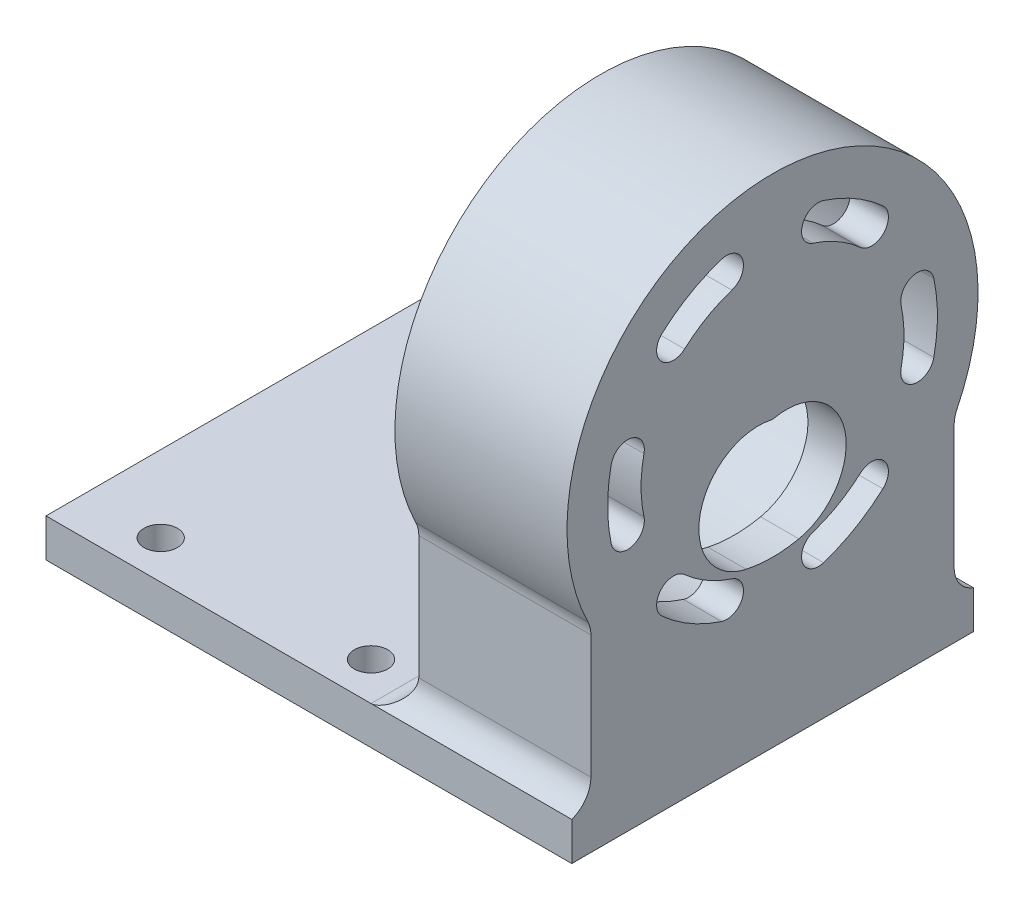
ISO-10303-21;
HEADER;
FILE_DESCRIPTION(('STEP AP214'),'2;1');
FILE_NAME('part.step','',(''),(''),'','','');
FILE_SCHEMA(('AUTOMOTIVE_DESIGN { 1 0 10303 214 1 1 1 1 }'));
ENDSEC;
DATA;
#1=APPLICATION_CONTEXT('core data for automotive mechanical design processes');
#2=APPLICATION_PROTOCOL_DEFINITION('international standard','automotive_design',2000,#1);
#3=PRODUCT_CONTEXT('',#1,'mechanical');
#4=PRODUCT('Part','Part','',(#3));
#5=PRODUCT_RELATED_PRODUCT_CATEGORY('part','',(#4));
#6=PRODUCT_DEFINITION_FORMATION('','',#4);
#7=PRODUCT_DEFINITION_CONTEXT('part definition',#1,'design');
#8=PRODUCT_DEFINITION('design','',#6,#7);
#9=PRODUCT_DEFINITION_SHAPE('','',#8);
#10=(LENGTH_UNIT() NAMED_UNIT(*) SI_UNIT(.MILLI.,.METRE.));
#11=(NAMED_UNIT(*) PLANE_ANGLE_UNIT() SI_UNIT($,.RADIAN.));
#12=(NAMED_UNIT(*) SI_UNIT($,.STERADIAN.) SOLID_ANGLE_UNIT());
#13=UNCERTAINTY_MEASURE_WITH_UNIT(LENGTH_MEASURE(1.E-05),#10,'distance_accuracy_value','');
#14=(GEOMETRIC_REPRESENTATION_CONTEXT(3) GLOBAL_UNCERTAINTY_ASSIGNED_CONTEXT((#13)) GLOBAL_UNIT_ASSIGNED_CONTEXT((#10,
#11,#12)) REPRESENTATION_CONTEXT('',''));
#15=CARTESIAN_POINT('',(0.,0.,0.));
#16=DIRECTION('',(0.,0.,1.));
#17=DIRECTION('',(1.,0.,0.));
#18=AXIS2_PLACEMENT_3D('',#15,#16,#17);
#19=CARTESIAN_POINT('',(27.5,-2.,21.));
#20=DIRECTION('',(-1.,0.,0.));
#21=DIRECTION('',(0.,0.,1.));
#22=AXIS2_PLACEMENT_3D('',#19,#20,#21);
#23=PLANE('',#22);
#24=CARTESIAN_POINT('',(27.5,28.5,0.));
#25=DIRECTION('',(1.,0.,0.));
#26=DIRECTION('',(0.,0.86602540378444,-0.499999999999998));
#27=AXIS2_PLACEMENT_3D('',#24,#25,#26);
#28=CIRCLE('',#27,17.25);
#29=CARTESIAN_POINT('',(27.5,24.9135233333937,-16.8730461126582));
#30=VERTEX_POINT('',#29);
#31=CARTESIAN_POINT('',(27.5,32.0864766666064,-16.8730461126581));
#32=VERTEX_POINT('',#31);
#33=EDGE_CURVE('E341',#30,#32,#28,.T.);
#34=ORIENTED_EDGE('',*,*,#33,.F.);
#35=CARTESIAN_POINT('',(27.5,25.2773687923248,-15.161287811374));
#36=DIRECTION('',(1.,0.,0.));
#37=DIRECTION('',(0.,0.86602540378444,-0.499999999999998));
#38=AXIS2_PLACEMENT_3D('',#35,#36,#37);
#39=CIRCLE('',#38,1.75);
#40=CARTESIAN_POINT('',(27.5,25.6412142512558,-13.4495295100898));
#41=VERTEX_POINT('',#40);
#42=EDGE_CURVE('E339',#41,#30,#39,.T.);
#43=ORIENTED_EDGE('',*,*,#42,.F.);
#44=CARTESIAN_POINT('',(27.5,28.5,0.));
#45=DIRECTION('',(-1.,0.,0.));
#46=DIRECTION('',(0.,0.86602540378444,-0.499999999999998));
#47=AXIS2_PLACEMENT_3D('',#44,#45,#46);
#48=CIRCLE('',#47,13.75);
#49=CARTESIAN_POINT('',(27.5,31.3587857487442,-13.4495295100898));
#50=VERTEX_POINT('',#49);
#51=EDGE_CURVE('E348',#50,#41,#48,.T.);
#52=ORIENTED_EDGE('',*,*,#51,.F.);
#53=CARTESIAN_POINT('',(27.5,31.7226312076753,-15.161287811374));
#54=DIRECTION('',(1.,0.,0.));
#55=DIRECTION('',(0.,0.86602540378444,-0.499999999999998));
#56=AXIS2_PLACEMENT_3D('',#53,#54,#55);
#57=CIRCLE('',#56,1.75);
#58=EDGE_CURVE('E345',#32,#50,#57,.T.);
#59=ORIENTED_EDGE('',*,*,#58,.F.);
#60=EDGE_LOOP('',(#34,#43,#52,#59));
#61=FACE_BOUND('',#60,.T.);
#62=CARTESIAN_POINT('',(27.5,28.5,0.));
#63=DIRECTION('',(1.,0.,0.));
#64=DIRECTION('',(0.,0.866025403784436,0.500000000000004));
#65=AXIS2_PLACEMENT_3D('',#62,#63,#64);
#66=CIRCLE('',#65,17.25);
#67=CARTESIAN_POINT('',(27.5,41.3192482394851,-11.5425029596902));
#68=VERTEX_POINT('',#67);
#69=CARTESIAN_POINT('',(27.5,44.9057249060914,-5.33054315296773));
#70=VERTEX_POINT('',#69);
#71=EDGE_CURVE('E363',#68,#70,#66,.T.);
#72=ORIENTED_EDGE('',*,*,#71,.F.);
#73=CARTESIAN_POINT('',(27.5,40.0187447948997,-10.3715243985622));
#74=DIRECTION('',(1.,0.,0.));
#75=DIRECTION('',(0.,0.866025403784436,0.500000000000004));
#76=AXIS2_PLACEMENT_3D('',#73,#74,#75);
#77=CIRCLE('',#76,1.75);
#78=CARTESIAN_POINT('',(27.5,38.7182413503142,-9.20054583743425));
#79=VERTEX_POINT('',#78);
#80=EDGE_CURVE('E361',#79,#68,#77,.T.);
#81=ORIENTED_EDGE('',*,*,#80,.F.);
#82=CARTESIAN_POINT('',(27.5,28.5,0.));
#83=DIRECTION('',(-1.,0.,0.));
#84=DIRECTION('',(0.,0.866025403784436,0.500000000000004));
#85=AXIS2_PLACEMENT_3D('',#82,#83,#84);
#86=CIRCLE('',#85,13.75);
#87=CARTESIAN_POINT('',(27.5,41.5770270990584,-4.24898367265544));
#88=VERTEX_POINT('',#87);
#89=EDGE_CURVE('E370',#88,#79,#86,.T.);
#90=ORIENTED_EDGE('',*,*,#89,.F.);
#91=CARTESIAN_POINT('',(27.5,43.2413760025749,-4.78976341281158));
#92=DIRECTION('',(1.,0.,0.));
#93=DIRECTION('',(0.,0.866025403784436,0.500000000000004));
#94=AXIS2_PLACEMENT_3D('',#91,#92,#93);
#95=CIRCLE('',#94,1.75);
#96=EDGE_CURVE('E367',#70,#88,#95,.T.);
#97=ORIENTED_EDGE('',*,*,#96,.F.);
#98=EDGE_LOOP('',(#72,#81,#90,#97));
#99=FACE_BOUND('',#98,.T.);
#100=CARTESIAN_POINT('',(27.5,28.5,0.));
#101=DIRECTION('',(1.,0.,0.));
#102=DIRECTION('',(0.,0.,1.));
#103=AXIS2_PLACEMENT_3D('',#100,#101,#102);
#104=CIRCLE('',#103,17.25);
#105=CARTESIAN_POINT('',(27.5,44.9057249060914,5.33054315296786));
#106=VERTEX_POINT('',#105);
#107=CARTESIAN_POINT('',(27.5,41.319248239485,11.5425029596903));
#108=VERTEX_POINT('',#107);
#109=EDGE_CURVE('E383',#106,#108,#104,.T.);
#110=ORIENTED_EDGE('',*,*,#109,.F.);
#111=CARTESIAN_POINT('',(27.5,43.2413760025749,4.7897634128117));
#112=DIRECTION('',(1.,0.,0.));
#113=DIRECTION('',(0.,0.,1.));
#114=AXIS2_PLACEMENT_3D('',#111,#112,#113);
#115=CIRCLE('',#114,1.75);
#116=CARTESIAN_POINT('',(27.5,41.5770270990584,4.24898367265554));
#117=VERTEX_POINT('',#116);
#118=EDGE_CURVE('E381',#117,#106,#115,.T.);
#119=ORIENTED_EDGE('',*,*,#118,.F.);
#120=CARTESIAN_POINT('',(27.5,28.5,0.));
#121=DIRECTION('',(-1.,0.,0.));
#122=DIRECTION('',(0.,0.,1.));
#123=AXIS2_PLACEMENT_3D('',#120,#121,#122);
#124=CIRCLE('',#123,13.75);
#125=CARTESIAN_POINT('',(27.5,38.7182413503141,9.20054583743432));
#126=VERTEX_POINT('',#125);
#127=EDGE_CURVE('E390',#126,#117,#124,.T.);
#128=ORIENTED_EDGE('',*,*,#127,.F.);
#129=CARTESIAN_POINT('',(27.5,40.0187447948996,10.3715243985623));
#130=DIRECTION('',(1.,0.,0.));
#131=DIRECTION('',(0.,0.,1.));
#132=AXIS2_PLACEMENT_3D('',#129,#130,#131);
#133=CIRCLE('',#132,1.75);
#134=EDGE_CURVE('E387',#108,#126,#133,.T.);
#135=ORIENTED_EDGE('',*,*,#134,.F.);
#136=EDGE_LOOP('',(#110,#119,#128,#135));
#137=FACE_BOUND('',#136,.T.);
#138=CARTESIAN_POINT('',(27.5,28.5,0.));
#139=DIRECTION('',(1.,0.,0.));
#140=DIRECTION('',(0.,-0.866025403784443,0.499999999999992));
#141=AXIS2_PLACEMENT_3D('',#138,#139,#140);
#142=CIRCLE('',#141,17.25);
#143=CARTESIAN_POINT('',(27.5,32.0864766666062,16.8730461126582));
#144=VERTEX_POINT('',#143);
#145=CARTESIAN_POINT('',(27.5,24.9135233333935,16.8730461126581));
#146=VERTEX_POINT('',#145);
#147=EDGE_CURVE('E403',#144,#146,#142,.T.);
#148=ORIENTED_EDGE('',*,*,#147,.F.);
#149=CARTESIAN_POINT('',(27.5,31.7226312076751,15.161287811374));
#150=DIRECTION('',(1.,0.,0.));
#151=DIRECTION('',(0.,-0.866025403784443,0.499999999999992));
#152=AXIS2_PLACEMENT_3D('',#149,#150,#151);
#153=CIRCLE('',#152,1.75);
#154=CARTESIAN_POINT('',(27.5,31.3587857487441,13.4495295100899));
#155=VERTEX_POINT('',#154);
#156=EDGE_CURVE('E401',#155,#144,#153,.T.);
#157=ORIENTED_EDGE('',*,*,#156,.F.);
#158=CARTESIAN_POINT('',(27.5,28.5,0.));
#159=DIRECTION('',(-1.,0.,0.));
#160=DIRECTION('',(0.,-0.866025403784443,0.499999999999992));
#161=AXIS2_PLACEMENT_3D('',#158,#159,#160);
#162=CIRCLE('',#161,13.75);
#163=CARTESIAN_POINT('',(27.5,25.6412142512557,13.4495295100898));
#164=VERTEX_POINT('',#163);
#165=EDGE_CURVE('E410',#164,#155,#162,.T.);
#166=ORIENTED_EDGE('',*,*,#165,.F.);
#167=CARTESIAN_POINT('',(27.5,25.2773687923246,15.161287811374));
#168=DIRECTION('',(1.,0.,0.));
#169=DIRECTION('',(0.,-0.866025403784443,0.499999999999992));
#170=AXIS2_PLACEMENT_3D('',#167,#168,#169);
#171=CIRCLE('',#170,1.75);
#172=EDGE_CURVE('E407',#146,#164,#171,.T.);
#173=ORIENTED_EDGE('',*,*,#172,.F.);
#174=EDGE_LOOP('',(#148,#157,#166,#173));
#175=FACE_BOUND('',#174,.T.);
#176=CARTESIAN_POINT('',(27.5,28.5,0.));
#177=DIRECTION('',(1.,0.,0.));
#178=DIRECTION('',(0.,-0.866025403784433,-0.50000000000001));
#179=AXIS2_PLACEMENT_3D('',#176,#177,#178);
#180=CIRCLE('',#179,17.25);
#181=CARTESIAN_POINT('',(27.5,15.6807517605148,11.5425029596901));
#182=VERTEX_POINT('',#181);
#183=CARTESIAN_POINT('',(27.5,12.0942750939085,5.33054315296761));
#184=VERTEX_POINT('',#183);
#185=EDGE_CURVE('E422',#182,#184,#180,.T.);
#186=ORIENTED_EDGE('',*,*,#185,.F.);
#187=CARTESIAN_POINT('',(27.5,16.9812552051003,10.3715243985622));
#188=DIRECTION('',(1.,0.,0.));
#189=DIRECTION('',(0.,-0.866025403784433,-0.50000000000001));
#190=AXIS2_PLACEMENT_3D('',#187,#188,#189);
#191=CIRCLE('',#190,1.75);
#192=CARTESIAN_POINT('',(27.5,18.2817586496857,9.20054583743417));
#193=VERTEX_POINT('',#192);
#194=EDGE_CURVE('E336',#193,#182,#191,.T.);
#195=ORIENTED_EDGE('',*,*,#194,.F.);
#196=CARTESIAN_POINT('',(27.5,28.5,0.));
#197=DIRECTION('',(-1.,0.,0.));
#198=DIRECTION('',(0.,-0.866025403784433,-0.50000000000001));
#199=AXIS2_PLACEMENT_3D('',#196,#197,#198);
#200=CIRCLE('',#199,13.75);
#201=CARTESIAN_POINT('',(27.5,15.4229729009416,4.24898367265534));
#202=VERTEX_POINT('',#201);
#203=EDGE_CURVE('E428',#202,#193,#200,.T.);
#204=ORIENTED_EDGE('',*,*,#203,.F.);
#205=CARTESIAN_POINT('',(27.5,13.758623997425,4.78976341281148));
#206=DIRECTION('',(1.,0.,0.));
#207=DIRECTION('',(0.,-0.866025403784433,-0.50000000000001));
#208=AXIS2_PLACEMENT_3D('',#205,#206,#207);
#209=CIRCLE('',#208,1.75);
#210=EDGE_CURVE('E425',#184,#202,#209,.T.);
#211=ORIENTED_EDGE('',*,*,#210,.F.);
#212=EDGE_LOOP('',(#186,#195,#204,#211));
#213=FACE_BOUND('',#212,.T.);
#214=CARTESIAN_POINT('',(27.5,28.5,0.));
#215=DIRECTION('',(1.,0.,0.));
#216=DIRECTION('',(0.,0.,-1.));
#217=AXIS2_PLACEMENT_3D('',#214,#215,#216);
#218=CIRCLE('',#217,17.25);
#219=CARTESIAN_POINT('',(27.5,12.0942750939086,-5.33054315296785));
#220=VERTEX_POINT('',#219);
#221=CARTESIAN_POINT('',(27.5,15.680751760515,-11.5425029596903));
#222=VERTEX_POINT('',#221);
#223=EDGE_CURVE('E440',#220,#222,#218,.T.);
#224=ORIENTED_EDGE('',*,*,#223,.F.);
#225=CARTESIAN_POINT('',(27.5,13.7586239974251,-4.7897634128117));
#226=DIRECTION('',(1.,0.,0.));
#227=DIRECTION('',(0.,0.,-1.));
#228=AXIS2_PLACEMENT_3D('',#225,#226,#227);
#229=CIRCLE('',#228,1.75);
#230=CARTESIAN_POINT('',(27.5,15.4229729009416,-4.24898367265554));
#231=VERTEX_POINT('',#230);
#232=EDGE_CURVE('E354',#231,#220,#229,.T.);
#233=ORIENTED_EDGE('',*,*,#232,.F.);
#234=CARTESIAN_POINT('',(27.5,28.5,0.));
#235=DIRECTION('',(-1.,0.,0.));
#236=DIRECTION('',(0.,0.,-1.));
#237=AXIS2_PLACEMENT_3D('',#234,#235,#236);
#238=CIRCLE('',#237,13.75);
#239=CARTESIAN_POINT('',(27.5,18.2817586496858,-9.20054583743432));
#240=VERTEX_POINT('',#239);
#241=EDGE_CURVE('E446',#240,#231,#238,.T.);
#242=ORIENTED_EDGE('',*,*,#241,.F.);
#243=CARTESIAN_POINT('',(27.5,16.9812552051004,-10.3715243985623));
#244=DIRECTION('',(1.,0.,0.));
#245=DIRECTION('',(0.,0.,-1.));
#246=AXIS2_PLACEMENT_3D('',#243,#244,#245);
#247=CIRCLE('',#246,1.75);
#248=EDGE_CURVE('E443',#222,#240,#247,.T.);
#249=ORIENTED_EDGE('',*,*,#248,.F.);
#250=EDGE_LOOP('',(#224,#233,#242,#249));
#251=FACE_BOUND('',#250,.T.);
#252=DIRECTION('',(0.,1.,0.));
#253=VECTOR('',#252,1.);
#254=CARTESIAN_POINT('',(27.5,-2.,-21.));
#255=LINE('',#254,#253);
#256=CARTESIAN_POINT('',(27.5,-2.,-21.));
#257=VERTEX_POINT('',#256);
#258=CARTESIAN_POINT('',(27.5,2.,-21.));
#259=VERTEX_POINT('',#258);
#260=EDGE_CURVE('E497',#257,#259,#255,.T.);
#261=ORIENTED_EDGE('',*,*,#260,.T.);
#262=CARTESIAN_POINT('',(27.5,4.82842712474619,-22.));
#263=DIRECTION('',(-1.,0.,0.));
#264=DIRECTION('',(0.,0.,1.));
#265=AXIS2_PLACEMENT_3D('',#262,#263,#264);
#266=CIRCLE('',#265,3.);
#267=CARTESIAN_POINT('',(27.5,4.82842712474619,-19.));
#268=VERTEX_POINT('',#267);
#269=EDGE_CURVE('E627',#259,#268,#266,.T.);
#270=ORIENTED_EDGE('',*,*,#269,.T.);
#271=DIRECTION('',(0.,1.,0.));
#272=VECTOR('',#271,1.);
#273=CARTESIAN_POINT('',(27.5,2.,-19.));
#274=LINE('',#273,#272);
#275=CARTESIAN_POINT('',(27.5,17.7180706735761,-19.));
#276=VERTEX_POINT('',#275);
#277=EDGE_CURVE('E462',#268,#276,#274,.T.);
#278=ORIENTED_EDGE('',*,*,#277,.T.);
#279=CARTESIAN_POINT('',(27.5,17.7180706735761,-22.));
#280=DIRECTION('',(-1.,0.,0.));
#281=DIRECTION('',(0.,0.,1.));
#282=AXIS2_PLACEMENT_3D('',#279,#280,#281);
#283=CIRCLE('',#282,3.);
#284=CARTESIAN_POINT('',(27.5,19.038306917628,-19.3061224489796));
#285=VERTEX_POINT('',#284);
#286=EDGE_CURVE('E623',#276,#285,#283,.T.);
#287=ORIENTED_EDGE('',*,*,#286,.T.);
#288=CARTESIAN_POINT('',(27.5,28.5,0.));
#289=DIRECTION('',(1.,0.,0.));
#290=DIRECTION('',(0.,0.,-1.));
#291=AXIS2_PLACEMENT_3D('',#288,#289,#290);
#292=CIRCLE('',#291,21.5);
#293=CARTESIAN_POINT('',(27.5,19.038306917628,19.3061224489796));
#294=VERTEX_POINT('',#293);
#295=EDGE_CURVE('E477',#285,#294,#292,.T.);
#296=ORIENTED_EDGE('',*,*,#295,.T.);
#297=CARTESIAN_POINT('',(27.5,17.7180706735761,22.));
#298=DIRECTION('',(-1.,0.,0.));
#299=DIRECTION('',(0.,0.,1.));
#300=AXIS2_PLACEMENT_3D('',#297,#298,#299);
#301=CIRCLE('',#300,3.);
#302=CARTESIAN_POINT('',(27.5,17.7180706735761,19.));
#303=VERTEX_POINT('',#302);
#304=EDGE_CURVE('E619',#294,#303,#301,.T.);
#305=ORIENTED_EDGE('',*,*,#304,.T.);
#306=DIRECTION('',(0.,-1.,0.));
#307=VECTOR('',#306,1.);
#308=CARTESIAN_POINT('',(27.5,2.,19.));
#309=LINE('',#308,#307);
#310=CARTESIAN_POINT('',(27.5,4.82842712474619,19.));
#311=VERTEX_POINT('',#310);
#312=EDGE_CURVE('E469',#303,#311,#309,.T.);
#313=ORIENTED_EDGE('',*,*,#312,.T.);
#314=CARTESIAN_POINT('',(27.5,4.82842712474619,22.));
#315=DIRECTION('',(-1.,0.,0.));
#316=DIRECTION('',(0.,0.,1.));
#317=AXIS2_PLACEMENT_3D('',#314,#315,#316);
#318=CIRCLE('',#317,3.);
#319=CARTESIAN_POINT('',(27.5,2.,21.));
#320=VERTEX_POINT('',#319);
#321=EDGE_CURVE('E49',#311,#320,#318,.T.);
#322=ORIENTED_EDGE('',*,*,#321,.T.);
#323=DIRECTION('',(0.,1.,0.));
#324=VECTOR('',#323,1.);
#325=CARTESIAN_POINT('',(27.5,-2.,21.));
#326=LINE('',#325,#324);
#327=CARTESIAN_POINT('',(27.5,-2.,21.));
#328=VERTEX_POINT('',#327);
#329=EDGE_CURVE('E506',#328,#320,#326,.T.);
#330=ORIENTED_EDGE('',*,*,#329,.F.);
#331=DIRECTION('',(0.,0.,-1.));
#332=VECTOR('',#331,1.);
#333=CARTESIAN_POINT('',(27.5,-2.,21.));
#334=LINE('',#333,#332);
#335=EDGE_CURVE('E518',#328,#257,#334,.T.);
#336=ORIENTED_EDGE('',*,*,#335,.T.);
#337=EDGE_LOOP('',(#261,#270,#278,#287,#296,#305,#313,#322,#330,#336));
#338=FACE_BOUND('',#337,.T.);
#339=CARTESIAN_POINT('',(27.5,28.5,0.));
#340=DIRECTION('',(-1.,0.,0.));
#341=DIRECTION('',(0.,0.,-1.));
#342=AXIS2_PLACEMENT_3D('',#339,#340,#341);
#343=CIRCLE('',#342,0.749999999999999);
#344=CARTESIAN_POINT('',(27.5,27.7663892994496,-0.155933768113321));
#345=VERTEX_POINT('',#344);
#346=CARTESIAN_POINT('',(27.5,27.7663892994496,0.155933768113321));
#347=VERTEX_POINT('',#346);
#348=EDGE_CURVE('E321',#345,#347,#343,.T.);
#349=ORIENTED_EDGE('',*,*,#348,.F.);
#350=CARTESIAN_POINT('',(27.5,21.6529667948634,-1.45538183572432));
#351=DIRECTION('',(1.,0.,0.));
#352=DIRECTION('',(0.,0.,-1.));
#353=AXIS2_PLACEMENT_3D('',#350,#351,#352);
#354=CIRCLE('',#353,6.25);
#355=CARTESIAN_POINT('',(27.5,15.5395442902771,-2.75482990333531));
#356=VERTEX_POINT('',#355);
#357=EDGE_CURVE('E326',#356,#345,#354,.T.);
#358=ORIENTED_EDGE('',*,*,#357,.F.);
#359=CARTESIAN_POINT('',(27.5,28.5,0.));
#360=DIRECTION('',(1.,0.,0.));
#361=DIRECTION('',(0.,0.,-1.));
#362=AXIS2_PLACEMENT_3D('',#359,#360,#361);
#363=CIRCLE('',#362,13.25);
#364=CARTESIAN_POINT('',(27.5,15.5395442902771,2.75482990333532));
#365=VERTEX_POINT('',#364);
#366=EDGE_CURVE('E329',#365,#356,#363,.T.);
#367=ORIENTED_EDGE('',*,*,#366,.F.);
#368=CARTESIAN_POINT('',(27.5,21.6529667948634,1.45538183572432));
#369=DIRECTION('',(1.,0.,0.));
#370=DIRECTION('',(0.,0.,-1.));
#371=AXIS2_PLACEMENT_3D('',#368,#369,#370);
#372=CIRCLE('',#371,6.25);
#373=EDGE_CURVE('E310',#347,#365,#372,.T.);
#374=ORIENTED_EDGE('',*,*,#373,.F.);
#375=EDGE_LOOP('',(#349,#358,#367,#374));
#376=FACE_BOUND('',#375,.T.);
#377=ADVANCED_FACE('F34',(#61,#99,#137,#175,#213,#251,#338,#376),#23,.F.);
#378=CARTESIAN_POINT('',(23.5,28.5,0.));
#379=DIRECTION('',(-1.,0.,0.));
#380=DIRECTION('',(0.,0.,1.));
#381=AXIS2_PLACEMENT_3D('',#378,#379,#380);
#382=PLANE('',#381);
#383=CARTESIAN_POINT('',(23.5,28.5,0.));
#384=DIRECTION('',(-1.,0.,0.));
#385=DIRECTION('',(0.,0.,1.));
#386=AXIS2_PLACEMENT_3D('',#383,#384,#385);
#387=CIRCLE('',#386,18.6);
#388=CARTESIAN_POINT('',(23.5,28.5,18.6));
#389=VERTEX_POINT('',#388);
#390=EDGE_CURVE('E459',#389,#389,#387,.T.);
#391=ORIENTED_EDGE('',*,*,#390,.T.);
#392=EDGE_LOOP('',(#391));
#393=FACE_BOUND('',#392,.T.);
#394=CARTESIAN_POINT('',(23.5,13.7586239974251,-4.7897634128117));
#395=DIRECTION('',(-1.,0.,0.));
#396=DIRECTION('',(0.,0.,1.));
#397=AXIS2_PLACEMENT_3D('',#394,#395,#396);
#398=CIRCLE('',#397,1.75);
#399=CARTESIAN_POINT('',(23.5,12.0942750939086,-5.33054315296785));
#400=VERTEX_POINT('',#399);
#401=CARTESIAN_POINT('',(23.5,15.4229729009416,-4.24898367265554));
#402=VERTEX_POINT('',#401);
#403=EDGE_CURVE('E543',#400,#402,#398,.T.);
#404=ORIENTED_EDGE('',*,*,#403,.F.);
#405=CARTESIAN_POINT('',(23.5,28.5,0.));
#406=DIRECTION('',(-1.,0.,0.));
#407=DIRECTION('',(0.,0.,1.));
#408=AXIS2_PLACEMENT_3D('',#405,#406,#407);
#409=CIRCLE('',#408,17.25);
#410=CARTESIAN_POINT('',(23.5,15.680751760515,-11.5425029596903));
#411=VERTEX_POINT('',#410);
#412=EDGE_CURVE('E536',#411,#400,#409,.T.);
#413=ORIENTED_EDGE('',*,*,#412,.F.);
#414=CARTESIAN_POINT('',(23.5,16.9812552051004,-10.3715243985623));
#415=DIRECTION('',(-1.,0.,0.));
#416=DIRECTION('',(0.,0.,1.));
#417=AXIS2_PLACEMENT_3D('',#414,#415,#416);
#418=CIRCLE('',#417,1.75);
#419=CARTESIAN_POINT('',(23.5,18.2817586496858,-9.20054583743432));
#420=VERTEX_POINT('',#419);
#421=EDGE_CURVE('E538',#420,#411,#418,.T.);
#422=ORIENTED_EDGE('',*,*,#421,.F.);
#423=CARTESIAN_POINT('',(23.5,28.5,0.));
#424=DIRECTION('',(-1.,0.,0.));
#425=DIRECTION('',(0.,0.,1.));
#426=AXIS2_PLACEMENT_3D('',#423,#424,#425);
#427=CIRCLE('',#426,13.75);
#428=EDGE_CURVE('E541',#402,#420,#427,.F.);
#429=ORIENTED_EDGE('',*,*,#428,.F.);
#430=EDGE_LOOP('',(#404,#413,#422,#429));
#431=FACE_BOUND('',#430,.T.);
#432=CARTESIAN_POINT('',(23.5,16.9812552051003,10.3715243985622));
#433=DIRECTION('',(-1.,0.,0.));
#434=DIRECTION('',(0.,0.,1.));
#435=AXIS2_PLACEMENT_3D('',#432,#433,#434);
#436=CIRCLE('',#435,1.75);
#437=CARTESIAN_POINT('',(23.5,15.6807517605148,11.5425029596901));
#438=VERTEX_POINT('',#437);
#439=CARTESIAN_POINT('',(23.5,18.2817586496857,9.20054583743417));
#440=VERTEX_POINT('',#439);
#441=EDGE_CURVE('E552',#438,#440,#436,.T.);
#442=ORIENTED_EDGE('',*,*,#441,.F.);
#443=CARTESIAN_POINT('',(23.5,28.5,0.));
#444=DIRECTION('',(-1.,0.,0.));
#445=DIRECTION('',(0.,0.,1.));
#446=AXIS2_PLACEMENT_3D('',#443,#444,#445);
#447=CIRCLE('',#446,17.25);
#448=CARTESIAN_POINT('',(23.5,12.0942750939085,5.33054315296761));
#449=VERTEX_POINT('',#448);
#450=EDGE_CURVE('E545',#449,#438,#447,.T.);
#451=ORIENTED_EDGE('',*,*,#450,.F.);
#452=CARTESIAN_POINT('',(23.5,13.758623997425,4.78976341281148));
#453=DIRECTION('',(-1.,0.,0.));
#454=DIRECTION('',(0.,0.,1.));
#455=AXIS2_PLACEMENT_3D('',#452,#453,#454);
#456=CIRCLE('',#455,1.75);
#457=CARTESIAN_POINT('',(23.5,15.4229729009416,4.24898367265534));
#458=VERTEX_POINT('',#457);
#459=EDGE_CURVE('E547',#458,#449,#456,.T.);
#460=ORIENTED_EDGE('',*,*,#459,.F.);
#461=CARTESIAN_POINT('',(23.5,28.5,0.));
#462=DIRECTION('',(-1.,0.,0.));
#463=DIRECTION('',(0.,0.,1.));
#464=AXIS2_PLACEMENT_3D('',#461,#462,#463);
#465=CIRCLE('',#464,13.75);
#466=EDGE_CURVE('E550',#440,#458,#465,.F.);
#467=ORIENTED_EDGE('',*,*,#466,.F.);
#468=EDGE_LOOP('',(#442,#451,#460,#467));
#469=FACE_BOUND('',#468,.T.);
#470=CARTESIAN_POINT('',(23.5,31.7226312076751,15.161287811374));
#471=DIRECTION('',(-1.,0.,0.));
#472=DIRECTION('',(0.,0.,1.));
#473=AXIS2_PLACEMENT_3D('',#470,#471,#472);
#474=CIRCLE('',#473,1.75);
#475=CARTESIAN_POINT('',(23.5,32.0864766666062,16.8730461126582));
#476=VERTEX_POINT('',#475);
#477=CARTESIAN_POINT('',(23.5,31.3587857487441,13.4495295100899));
#478=VERTEX_POINT('',#477);
#479=EDGE_CURVE('E561',#476,#478,#474,.T.);
#480=ORIENTED_EDGE('',*,*,#479,.F.);
#481=CARTESIAN_POINT('',(23.5,28.5,0.));
#482=DIRECTION('',(-1.,0.,0.));
#483=DIRECTION('',(0.,0.,1.));
#484=AXIS2_PLACEMENT_3D('',#481,#482,#483);
#485=CIRCLE('',#484,17.25);
#486=CARTESIAN_POINT('',(23.5,24.9135233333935,16.8730461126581));
#487=VERTEX_POINT('',#486);
#488=EDGE_CURVE('E554',#487,#476,#485,.T.);
#489=ORIENTED_EDGE('',*,*,#488,.F.);
#490=CARTESIAN_POINT('',(23.5,25.2773687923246,15.161287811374));
#491=DIRECTION('',(-1.,0.,0.));
#492=DIRECTION('',(0.,0.,1.));
#493=AXIS2_PLACEMENT_3D('',#490,#491,#492);
#494=CIRCLE('',#493,1.75);
#495=CARTESIAN_POINT('',(23.5,25.6412142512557,13.4495295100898));
#496=VERTEX_POINT('',#495);
#497=EDGE_CURVE('E556',#496,#487,#494,.T.);
#498=ORIENTED_EDGE('',*,*,#497,.F.);
#499=CARTESIAN_POINT('',(23.5,28.5,0.));
#500=DIRECTION('',(-1.,0.,0.));
#501=DIRECTION('',(0.,0.,1.));
#502=AXIS2_PLACEMENT_3D('',#499,#500,#501);
#503=CIRCLE('',#502,13.75);
#504=EDGE_CURVE('E559',#478,#496,#503,.F.);
#505=ORIENTED_EDGE('',*,*,#504,.F.);
#506=EDGE_LOOP('',(#480,#489,#498,#505));
#507=FACE_BOUND('',#506,.T.);
#508=CARTESIAN_POINT('',(23.5,43.2413760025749,4.7897634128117));
#509=DIRECTION('',(-1.,0.,0.));
#510=DIRECTION('',(0.,0.,1.));
#511=AXIS2_PLACEMENT_3D('',#508,#509,#510);
#512=CIRCLE('',#511,1.75);
#513=CARTESIAN_POINT('',(23.5,44.9057249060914,5.33054315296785));
#514=VERTEX_POINT('',#513);
#515=CARTESIAN_POINT('',(23.5,41.5770270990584,4.24898367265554));
#516=VERTEX_POINT('',#515);
#517=EDGE_CURVE('E570',#514,#516,#512,.T.);
#518=ORIENTED_EDGE('',*,*,#517,.F.);
#519=CARTESIAN_POINT('',(23.5,28.5,0.));
#520=DIRECTION('',(-1.,0.,0.));
#521=DIRECTION('',(0.,0.,1.));
#522=AXIS2_PLACEMENT_3D('',#519,#520,#521);
#523=CIRCLE('',#522,17.25);
#524=CARTESIAN_POINT('',(23.5,41.319248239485,11.5425029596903));
#525=VERTEX_POINT('',#524);
#526=EDGE_CURVE('E563',#525,#514,#523,.T.);
#527=ORIENTED_EDGE('',*,*,#526,.F.);
#528=CARTESIAN_POINT('',(23.5,40.0187447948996,10.3715243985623));
#529=DIRECTION('',(-1.,0.,0.));
#530=DIRECTION('',(0.,0.,1.));
#531=AXIS2_PLACEMENT_3D('',#528,#529,#530);
#532=CIRCLE('',#531,1.75);
#533=CARTESIAN_POINT('',(23.5,38.7182413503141,9.20054583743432));
#534=VERTEX_POINT('',#533);
#535=EDGE_CURVE('E565',#534,#525,#532,.T.);
#536=ORIENTED_EDGE('',*,*,#535,.F.);
#537=CARTESIAN_POINT('',(23.5,28.5,0.));
#538=DIRECTION('',(-1.,0.,0.));
#539=DIRECTION('',(0.,0.,1.));
#540=AXIS2_PLACEMENT_3D('',#537,#538,#539);
#541=CIRCLE('',#540,13.75);
#542=EDGE_CURVE('E568',#516,#534,#541,.F.);
#543=ORIENTED_EDGE('',*,*,#542,.F.);
#544=EDGE_LOOP('',(#518,#527,#536,#543));
#545=FACE_BOUND('',#544,.T.);
#546=CARTESIAN_POINT('',(23.5,40.0187447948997,-10.3715243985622));
#547=DIRECTION('',(-1.,0.,0.));
#548=DIRECTION('',(0.,0.,1.));
#549=AXIS2_PLACEMENT_3D('',#546,#547,#548);
#550=CIRCLE('',#549,1.75);
#551=CARTESIAN_POINT('',(23.5,41.3192482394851,-11.5425029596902));
#552=VERTEX_POINT('',#551);
#553=CARTESIAN_POINT('',(23.5,38.7182413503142,-9.20054583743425));
#554=VERTEX_POINT('',#553);
#555=EDGE_CURVE('E579',#552,#554,#550,.T.);
#556=ORIENTED_EDGE('',*,*,#555,.F.);
#557=CARTESIAN_POINT('',(23.5,28.5,0.));
#558=DIRECTION('',(-1.,0.,0.));
#559=DIRECTION('',(0.,0.,1.));
#560=AXIS2_PLACEMENT_3D('',#557,#558,#559);
#561=CIRCLE('',#560,17.25);
#562=CARTESIAN_POINT('',(23.5,44.9057249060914,-5.33054315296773));
#563=VERTEX_POINT('',#562);
#564=EDGE_CURVE('E572',#563,#552,#561,.T.);
#565=ORIENTED_EDGE('',*,*,#564,.F.);
#566=CARTESIAN_POINT('',(23.5,43.2413760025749,-4.78976341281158));
#567=DIRECTION('',(-1.,0.,0.));
#568=DIRECTION('',(0.,0.,1.));
#569=AXIS2_PLACEMENT_3D('',#566,#567,#568);
#570=CIRCLE('',#569,1.75);
#571=CARTESIAN_POINT('',(23.5,41.5770270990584,-4.24898367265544));
#572=VERTEX_POINT('',#571);
#573=EDGE_CURVE('E574',#572,#563,#570,.T.);
#574=ORIENTED_EDGE('',*,*,#573,.F.);
#575=CARTESIAN_POINT('',(23.5,28.5,0.));
#576=DIRECTION('',(-1.,0.,0.));
#577=DIRECTION('',(0.,0.,1.));
#578=AXIS2_PLACEMENT_3D('',#575,#576,#577);
#579=CIRCLE('',#578,13.75);
#580=EDGE_CURVE('E577',#554,#572,#579,.F.);
#581=ORIENTED_EDGE('',*,*,#580,.F.);
#582=EDGE_LOOP('',(#556,#565,#574,#581));
#583=FACE_BOUND('',#582,.T.);
#584=CARTESIAN_POINT('',(23.5,25.2773687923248,-15.161287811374));
#585=DIRECTION('',(-1.,0.,0.));
#586=DIRECTION('',(0.,0.,1.));
#587=AXIS2_PLACEMENT_3D('',#584,#585,#586);
#588=CIRCLE('',#587,1.75);
#589=CARTESIAN_POINT('',(23.5,24.9135233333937,-16.8730461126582));
#590=VERTEX_POINT('',#589);
#591=CARTESIAN_POINT('',(23.5,25.6412142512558,-13.4495295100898));
#592=VERTEX_POINT('',#591);
#593=EDGE_CURVE('E588',#590,#592,#588,.T.);
#594=ORIENTED_EDGE('',*,*,#593,.F.);
#595=CARTESIAN_POINT('',(23.5,28.5,0.));
#596=DIRECTION('',(-1.,0.,0.));
#597=DIRECTION('',(0.,0.,1.));
#598=AXIS2_PLACEMENT_3D('',#595,#596,#597);
#599=CIRCLE('',#598,17.25);
#600=CARTESIAN_POINT('',(23.5,32.0864766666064,-16.8730461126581));
#601=VERTEX_POINT('',#600);
#602=EDGE_CURVE('E581',#601,#590,#599,.T.);
#603=ORIENTED_EDGE('',*,*,#602,.F.);
#604=CARTESIAN_POINT('',(23.5,31.7226312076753,-15.161287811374));
#605=DIRECTION('',(-1.,0.,0.));
#606=DIRECTION('',(0.,0.,1.));
#607=AXIS2_PLACEMENT_3D('',#604,#605,#606);
#608=CIRCLE('',#607,1.75);
#609=CARTESIAN_POINT('',(23.5,31.3587857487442,-13.4495295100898));
#610=VERTEX_POINT('',#609);
#611=EDGE_CURVE('E583',#610,#601,#608,.T.);
#612=ORIENTED_EDGE('',*,*,#611,.F.);
#613=CARTESIAN_POINT('',(23.5,28.5,0.));
#614=DIRECTION('',(-1.,0.,0.));
#615=DIRECTION('',(0.,0.,1.));
#616=AXIS2_PLACEMENT_3D('',#613,#614,#615);
#617=CIRCLE('',#616,13.75);
#618=EDGE_CURVE('E586',#592,#610,#617,.F.);
#619=ORIENTED_EDGE('',*,*,#618,.F.);
#620=EDGE_LOOP('',(#594,#603,#612,#619));
#621=FACE_BOUND('',#620,.T.);
#622=CARTESIAN_POINT('',(23.5,21.6529667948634,-1.45538183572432));
#623=DIRECTION('',(-1.,0.,0.));
#624=DIRECTION('',(0.,0.,1.));
#625=AXIS2_PLACEMENT_3D('',#622,#623,#624);
#626=CIRCLE('',#625,6.25);
#627=CARTESIAN_POINT('',(23.5,27.7663892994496,-0.155933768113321));
#628=VERTEX_POINT('',#627);
#629=CARTESIAN_POINT('',(23.5,15.5395442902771,-2.75482990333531));
#630=VERTEX_POINT('',#629);
#631=EDGE_CURVE('E595',#628,#630,#626,.T.);
#632=ORIENTED_EDGE('',*,*,#631,.F.);
#633=CARTESIAN_POINT('',(23.5,28.5,0.));
#634=DIRECTION('',(-1.,0.,0.));
#635=DIRECTION('',(0.,0.,1.));
#636=AXIS2_PLACEMENT_3D('',#633,#634,#635);
#637=CIRCLE('',#636,0.749999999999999);
#638=CARTESIAN_POINT('',(23.5,27.7663892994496,0.155933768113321));
#639=VERTEX_POINT('',#638);
#640=EDGE_CURVE('E590',#639,#628,#637,.F.);
#641=ORIENTED_EDGE('',*,*,#640,.F.);
#642=CARTESIAN_POINT('',(23.5,21.6529667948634,1.45538183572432));
#643=DIRECTION('',(-1.,0.,0.));
#644=DIRECTION('',(0.,0.,1.));
#645=AXIS2_PLACEMENT_3D('',#642,#643,#644);
#646=CIRCLE('',#645,6.25);
#647=CARTESIAN_POINT('',(23.5,15.5395442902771,2.75482990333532));
#648=VERTEX_POINT('',#647);
#649=EDGE_CURVE('E313',#648,#639,#646,.T.);
#650=ORIENTED_EDGE('',*,*,#649,.F.);
#651=CARTESIAN_POINT('',(23.5,28.5,0.));
#652=DIRECTION('',(-1.,0.,0.));
#653=DIRECTION('',(0.,0.,1.));
#654=AXIS2_PLACEMENT_3D('',#651,#652,#653);
#655=CIRCLE('',#654,13.25);
#656=EDGE_CURVE('E593',#630,#648,#655,.T.);
#657=ORIENTED_EDGE('',*,*,#656,.F.);
#658=EDGE_LOOP('',(#632,#641,#650,#657));
#659=FACE_BOUND('',#658,.T.);
#660=ADVANCED_FACE('F681',(#393,#431,#469,#507,#545,#583,#621,#659),#382,.T.);
#661=CARTESIAN_POINT('',(-27.5,2.,21.));
#662=DIRECTION('',(0.,-1.,0.));
#663=DIRECTION('',(0.,0.,-1.));
#664=AXIS2_PLACEMENT_3D('',#661,#662,#663);
#665=PLANE('',#664);
#666=CARTESIAN_POINT('',(2.49999999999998,2.,17.));
#667=DIRECTION('',(0.,1.,0.));
#668=DIRECTION('',(0.,0.,1.));
#669=AXIS2_PLACEMENT_3D('',#666,#667,#668);
#670=CIRCLE('',#669,1.75);
#671=CARTESIAN_POINT('',(2.49999999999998,2.,18.75));
#672=VERTEX_POINT('',#671);
#673=EDGE_CURVE('E485',#672,#672,#670,.T.);
#674=ORIENTED_EDGE('',*,*,#673,.F.);
#675=EDGE_LOOP('',(#674));
#676=FACE_BOUND('',#675,.T.);
#677=CARTESIAN_POINT('',(-19.5,2.,17.));
#678=DIRECTION('',(0.,1.,0.));
#679=DIRECTION('',(0.,0.,1.));
#680=AXIS2_PLACEMENT_3D('',#677,#678,#679);
#681=CIRCLE('',#680,1.75);
#682=CARTESIAN_POINT('',(-19.5,2.,18.75));
#683=VERTEX_POINT('',#682);
#684=EDGE_CURVE('E498',#683,#683,#681,.T.);
#685=ORIENTED_EDGE('',*,*,#684,.F.);
#686=EDGE_LOOP('',(#685));
#687=FACE_BOUND('',#686,.T.);
#688=CARTESIAN_POINT('',(2.49999999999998,2.,-17.));
#689=DIRECTION('',(0.,-1.,0.));
#690=DIRECTION('',(0.,0.,-1.));
#691=AXIS2_PLACEMENT_3D('',#688,#689,#690);
#692=CIRCLE('',#691,1.75);
#693=CARTESIAN_POINT('',(2.49999999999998,2.,-18.75));
#694=VERTEX_POINT('',#693);
#695=EDGE_CURVE('E474',#694,#694,#692,.T.);
#696=ORIENTED_EDGE('',*,*,#695,.T.);
#697=EDGE_LOOP('',(#696));
#698=FACE_BOUND('',#697,.T.);
#699=CARTESIAN_POINT('',(-19.5,2.,-17.));
#700=DIRECTION('',(0.,-1.,0.));
#701=DIRECTION('',(0.,0.,-1.));
#702=AXIS2_PLACEMENT_3D('',#699,#700,#701);
#703=CIRCLE('',#702,1.75);
#704=CARTESIAN_POINT('',(-19.5,2.,-18.75));
#705=VERTEX_POINT('',#704);
#706=EDGE_CURVE('E486',#705,#705,#703,.T.);
#707=ORIENTED_EDGE('',*,*,#706,.T.);
#708=EDGE_LOOP('',(#707));
#709=FACE_BOUND('',#708,.T.);
#710=DIRECTION('',(-1.,0.,0.));
#711=VECTOR('',#710,1.);
#712=CARTESIAN_POINT('',(-27.5,2.,21.));
#713=LINE('',#712,#711);
#714=CARTESIAN_POINT('',(6.49999999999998,2.,21.));
#715=VERTEX_POINT('',#714);
#716=CARTESIAN_POINT('',(-27.5,2.,21.));
#717=VERTEX_POINT('',#716);
#718=EDGE_CURVE('E509',#715,#717,#713,.T.);
#719=ORIENTED_EDGE('',*,*,#718,.F.);
#720=DIRECTION('',(0.,0.,-1.));
#721=VECTOR('',#720,1.);
#722=CARTESIAN_POINT('',(6.49999999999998,2.,-19.));
#723=LINE('',#722,#721);
#724=CARTESIAN_POINT('',(6.49999999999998,2.,-21.));
#725=VERTEX_POINT('',#724);
#726=EDGE_CURVE('E597',#715,#725,#723,.T.);
#727=ORIENTED_EDGE('',*,*,#726,.T.);
#728=DIRECTION('',(-1.,0.,0.));
#729=VECTOR('',#728,1.);
#730=CARTESIAN_POINT('',(-27.5,2.,-21.));
#731=LINE('',#730,#729);
#732=CARTESIAN_POINT('',(-27.5,2.,-21.));
#733=VERTEX_POINT('',#732);
#734=EDGE_CURVE('E521',#725,#733,#731,.T.);
#735=ORIENTED_EDGE('',*,*,#734,.T.);
#736=DIRECTION('',(0.,0.,-1.));
#737=VECTOR('',#736,1.);
#738=CARTESIAN_POINT('',(-27.5,2.,21.));
#739=LINE('',#738,#737);
#740=EDGE_CURVE('E533',#717,#733,#739,.T.);
#741=ORIENTED_EDGE('',*,*,#740,.F.);
#742=EDGE_LOOP('',(#719,#727,#735,#741));
#743=FACE_BOUND('',#742,.T.);
#744=ADVANCED_FACE('F677',(#676,#687,#698,#709,#743),#665,.F.);
#745=CARTESIAN_POINT('',(-27.5,-2.,21.));
#746=DIRECTION('',(1.,0.,0.));
#747=DIRECTION('',(0.,0.,-1.));
#748=AXIS2_PLACEMENT_3D('',#745,#746,#747);
#749=PLANE('',#748);
#750=DIRECTION('',(0.,-1.,0.));
#751=VECTOR('',#750,1.);
#752=CARTESIAN_POINT('',(-27.5,-2.,-21.));
#753=LINE('',#752,#751);
#754=CARTESIAN_POINT('',(-27.5,-2.,-21.));
#755=VERTEX_POINT('',#754);
#756=EDGE_CURVE('E525',#733,#755,#753,.T.);
#757=ORIENTED_EDGE('',*,*,#756,.T.);
#758=DIRECTION('',(0.,0.,-1.));
#759=VECTOR('',#758,1.);
#760=CARTESIAN_POINT('',(-27.5,-2.,21.));
#761=LINE('',#760,#759);
#762=CARTESIAN_POINT('',(-27.5,-2.,21.));
#763=VERTEX_POINT('',#762);
#764=EDGE_CURVE('E530',#763,#755,#761,.T.);
#765=ORIENTED_EDGE('',*,*,#764,.F.);
#766=DIRECTION('',(0.,-1.,0.));
#767=VECTOR('',#766,1.);
#768=CARTESIAN_POINT('',(-27.5,-2.,21.));
#769=LINE('',#768,#767);
#770=EDGE_CURVE('E514',#717,#763,#769,.T.);
#771=ORIENTED_EDGE('',*,*,#770,.F.);
#772=ORIENTED_EDGE('',*,*,#740,.T.);
#773=EDGE_LOOP('',(#757,#765,#771,#772));
#774=FACE_BOUND('',#773,.T.);
#775=ADVANCED_FACE('F673',(#774),#749,.F.);
#776=CARTESIAN_POINT('',(-27.5,-2.,21.));
#777=DIRECTION('',(0.,1.,0.));
#778=DIRECTION('',(0.,0.,1.));
#779=AXIS2_PLACEMENT_3D('',#776,#777,#778);
#780=PLANE('',#779);
#781=CARTESIAN_POINT('',(-19.5,-2.,-17.));
#782=DIRECTION('',(0.,-1.,0.));
#783=DIRECTION('',(0.,0.,-1.));
#784=AXIS2_PLACEMENT_3D('',#781,#782,#783);
#785=CIRCLE('',#784,1.75);
#786=CARTESIAN_POINT('',(-19.5,-2.,-18.75));
#787=VERTEX_POINT('',#786);
#788=EDGE_CURVE('E482',#787,#787,#785,.T.);
#789=ORIENTED_EDGE('',*,*,#788,.F.);
#790=EDGE_LOOP('',(#789));
#791=FACE_BOUND('',#790,.T.);
#792=CARTESIAN_POINT('',(2.49999999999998,-2.,-17.));
#793=DIRECTION('',(0.,-1.,0.));
#794=DIRECTION('',(0.,0.,-1.));
#795=AXIS2_PLACEMENT_3D('',#792,#793,#794);
#796=CIRCLE('',#795,1.75);
#797=CARTESIAN_POINT('',(2.49999999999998,-2.,-18.75));
#798=VERTEX_POINT('',#797);
#799=EDGE_CURVE('E489',#798,#798,#796,.T.);
#800=ORIENTED_EDGE('',*,*,#799,.F.);
#801=EDGE_LOOP('',(#800));
#802=FACE_BOUND('',#801,.T.);
#803=CARTESIAN_POINT('',(-19.5,-2.,17.));
#804=DIRECTION('',(0.,1.,0.));
#805=DIRECTION('',(0.,0.,1.));
#806=AXIS2_PLACEMENT_3D('',#803,#804,#805);
#807=CIRCLE('',#806,1.75);
#808=CARTESIAN_POINT('',(-19.5,-2.,18.75));
#809=VERTEX_POINT('',#808);
#810=EDGE_CURVE('E494',#809,#809,#807,.T.);
#811=ORIENTED_EDGE('',*,*,#810,.T.);
#812=EDGE_LOOP('',(#811));
#813=FACE_BOUND('',#812,.T.);
#814=CARTESIAN_POINT('',(2.49999999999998,-2.,17.));
#815=DIRECTION('',(0.,1.,0.));
#816=DIRECTION('',(0.,0.,1.));
#817=AXIS2_PLACEMENT_3D('',#814,#815,#816);
#818=CIRCLE('',#817,1.75);
#819=CARTESIAN_POINT('',(2.49999999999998,-2.,18.75));
#820=VERTEX_POINT('',#819);
#821=EDGE_CURVE('E501',#820,#820,#818,.T.);
#822=ORIENTED_EDGE('',*,*,#821,.T.);
#823=EDGE_LOOP('',(#822));
#824=FACE_BOUND('',#823,.T.);
#825=DIRECTION('',(1.,0.,0.));
#826=VECTOR('',#825,1.);
#827=CARTESIAN_POINT('',(-27.5,-2.,-21.));
#828=LINE('',#827,#826);
#829=EDGE_CURVE('E510',#755,#257,#828,.T.);
#830=ORIENTED_EDGE('',*,*,#829,.T.);
#831=ORIENTED_EDGE('',*,*,#335,.F.);
#832=DIRECTION('',(1.,0.,0.));
#833=VECTOR('',#832,1.);
#834=CARTESIAN_POINT('',(-27.5,-2.,21.));
#835=LINE('',#834,#833);
#836=EDGE_CURVE('E516',#763,#328,#835,.T.);
#837=ORIENTED_EDGE('',*,*,#836,.F.);
#838=ORIENTED_EDGE('',*,*,#764,.T.);
#839=EDGE_LOOP('',(#830,#831,#837,#838));
#840=FACE_BOUND('',#839,.T.);
#841=ADVANCED_FACE('F666',(#791,#802,#813,#824,#840),#780,.F.);
#842=CARTESIAN_POINT('',(0.,0.,21.));
#843=DIRECTION('',(0.,0.,-1.));
#844=DIRECTION('',(-1.,0.,0.));
#845=AXIS2_PLACEMENT_3D('',#842,#843,#844);
#846=PLANE('',#845);
#847=ORIENTED_EDGE('',*,*,#329,.T.);
#848=EDGE_CURVE('E511',#320,#715,#713,.T.);
#849=ORIENTED_EDGE('',*,*,#848,.T.);
#850=ORIENTED_EDGE('',*,*,#718,.T.);
#851=ORIENTED_EDGE('',*,*,#770,.T.);
#852=ORIENTED_EDGE('',*,*,#836,.T.);
#853=EDGE_LOOP('',(#847,#849,#850,#851,#852));
#854=FACE_BOUND('',#853,.T.);
#855=ADVANCED_FACE('F663',(#854),#846,.F.);
#856=CARTESIAN_POINT('',(0.,0.,-21.));
#857=DIRECTION('',(0.,0.,-1.));
#858=DIRECTION('',(-1.,0.,0.));
#859=AXIS2_PLACEMENT_3D('',#856,#857,#858);
#860=PLANE('',#859);
#861=ORIENTED_EDGE('',*,*,#260,.F.);
#862=ORIENTED_EDGE('',*,*,#829,.F.);
#863=ORIENTED_EDGE('',*,*,#756,.F.);
#864=ORIENTED_EDGE('',*,*,#734,.F.);
#865=EDGE_CURVE('E522',#259,#725,#731,.T.);
#866=ORIENTED_EDGE('',*,*,#865,.F.);
#867=EDGE_LOOP('',(#861,#862,#863,#864,#866));
#868=FACE_BOUND('',#867,.T.);
#869=ADVANCED_FACE('F661',(#868),#860,.T.);
#870=CARTESIAN_POINT('',(2.49999999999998,-2.,17.));
#871=DIRECTION('',(0.,1.,0.));
#872=DIRECTION('',(0.,0.,1.));
#873=AXIS2_PLACEMENT_3D('',#870,#871,#872);
#874=CYLINDRICAL_SURFACE('',#873,1.75);
#875=ORIENTED_EDGE('',*,*,#821,.F.);
#876=EDGE_LOOP('',(#875));
#877=FACE_BOUND('',#876,.T.);
#878=ORIENTED_EDGE('',*,*,#673,.T.);
#879=EDGE_LOOP('',(#878));
#880=FACE_BOUND('',#879,.T.);
#881=ADVANCED_FACE('F657',(#877,#880),#874,.F.);
#882=CARTESIAN_POINT('',(-19.5,-2.,17.));
#883=DIRECTION('',(0.,1.,0.));
#884=DIRECTION('',(0.,0.,1.));
#885=AXIS2_PLACEMENT_3D('',#882,#883,#884);
#886=CYLINDRICAL_SURFACE('',#885,1.75);
#887=ORIENTED_EDGE('',*,*,#810,.F.);
#888=EDGE_LOOP('',(#887));
#889=FACE_BOUND('',#888,.T.);
#890=ORIENTED_EDGE('',*,*,#684,.T.);
#891=EDGE_LOOP('',(#890));
#892=FACE_BOUND('',#891,.T.);
#893=ADVANCED_FACE('F653',(#889,#892),#886,.F.);
#894=CARTESIAN_POINT('',(2.49999999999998,-2.,-17.));
#895=DIRECTION('',(0.,1.,0.));
#896=DIRECTION('',(0.,0.,1.));
#897=AXIS2_PLACEMENT_3D('',#894,#895,#896);
#898=CYLINDRICAL_SURFACE('',#897,1.75);
#899=ORIENTED_EDGE('',*,*,#799,.T.);
#900=EDGE_LOOP('',(#899));
#901=FACE_BOUND('',#900,.T.);
#902=ORIENTED_EDGE('',*,*,#695,.F.);
#903=EDGE_LOOP('',(#902));
#904=FACE_BOUND('',#903,.T.);
#905=ADVANCED_FACE('F649',(#901,#904),#898,.F.);
#906=CARTESIAN_POINT('',(-19.5,-2.,-17.));
#907=DIRECTION('',(0.,1.,0.));
#908=DIRECTION('',(0.,0.,1.));
#909=AXIS2_PLACEMENT_3D('',#906,#907,#908);
#910=CYLINDRICAL_SURFACE('',#909,1.75);
#911=ORIENTED_EDGE('',*,*,#788,.T.);
#912=EDGE_LOOP('',(#911));
#913=FACE_BOUND('',#912,.T.);
#914=ORIENTED_EDGE('',*,*,#706,.F.);
#915=EDGE_LOOP('',(#914));
#916=FACE_BOUND('',#915,.T.);
#917=ADVANCED_FACE('F645',(#913,#916),#910,.F.);
#918=CARTESIAN_POINT('',(9.49999999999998,2.,19.));
#919=DIRECTION('',(0.,0.,1.));
#920=DIRECTION('',(1.,0.,0.));
#921=AXIS2_PLACEMENT_3D('',#918,#919,#920);
#922=PLANE('',#921);
#923=ORIENTED_EDGE('',*,*,#312,.F.);
#924=DIRECTION('',(-1.,0.,0.));
#925=VECTOR('',#924,1.);
#926=CARTESIAN_POINT('',(9.49999999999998,17.7180706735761,19.));
#927=LINE('',#926,#925);
#928=CARTESIAN_POINT('',(9.49999999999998,17.7180706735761,19.));
#929=VERTEX_POINT('',#928);
#930=EDGE_CURVE('E609',#303,#929,#927,.T.);
#931=ORIENTED_EDGE('',*,*,#930,.T.);
#932=DIRECTION('',(0.,-1.,0.));
#933=VECTOR('',#932,1.);
#934=CARTESIAN_POINT('',(9.49999999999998,2.,19.));
#935=LINE('',#934,#933);
#936=CARTESIAN_POINT('',(9.49999999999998,5.,19.));
#937=VERTEX_POINT('',#936);
#938=EDGE_CURVE('E472',#929,#937,#935,.T.);
#939=ORIENTED_EDGE('',*,*,#938,.T.);
#940=CARTESIAN_POINT('',(6.49999999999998,5.,19.));
#941=DIRECTION('',(0.,0.,1.));
#942=DIRECTION('',(1.,0.,0.));
#943=AXIS2_PLACEMENT_3D('',#940,#941,#942);
#944=CIRCLE('',#943,3.);
#945=CARTESIAN_POINT('',(9.49508977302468,4.82842712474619,19.));
#946=VERTEX_POINT('',#945);
#947=EDGE_CURVE('E56',#937,#946,#944,.F.);
#948=ORIENTED_EDGE('',*,*,#947,.T.);
#949=CARTESIAN_POINT('',(9.49508977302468,4.82842712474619,19.));
#950=CARTESIAN_POINT('',(9.49999999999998,4.82842712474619,19.));
#951=B_SPLINE_CURVE_WITH_KNOTS('',1,(#949,#950),.UNSPECIFIED.,.F.,.F.,(2,2),(0.,1.),.UNSPECIFIED.);
#952=CARTESIAN_POINT('',(9.49999999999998,4.82842712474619,19.));
#953=VERTEX_POINT('',#952);
#954=EDGE_CURVE('E11',#946,#953,#951,.T.);
#955=ORIENTED_EDGE('',*,*,#954,.T.);
#956=DIRECTION('',(-1.,0.,0.));
#957=VECTOR('',#956,1.);
#958=CARTESIAN_POINT('',(27.5,4.82842712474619,19.));
#959=LINE('',#958,#957);
#960=EDGE_CURVE('E607',#953,#311,#959,.F.);
#961=ORIENTED_EDGE('',*,*,#960,.T.);
#962=EDGE_LOOP('',(#923,#931,#939,#948,#955,#961));
#963=FACE_BOUND('',#962,.T.);
#964=ADVANCED_FACE('F648',(#963),#922,.T.);
#965=CARTESIAN_POINT('',(9.49999999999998,28.5,0.));
#966=DIRECTION('',(1.,0.,0.));
#967=DIRECTION('',(0.,0.,-1.));
#968=AXIS2_PLACEMENT_3D('',#965,#966,#967);
#969=CYLINDRICAL_SURFACE('',#968,21.5);
#970=CARTESIAN_POINT('',(9.49999999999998,28.5,0.));
#971=DIRECTION('',(1.,0.,0.));
#972=DIRECTION('',(0.,0.,-1.));
#973=AXIS2_PLACEMENT_3D('',#970,#971,#972);
#974=CIRCLE('',#973,21.5);
#975=CARTESIAN_POINT('',(9.49999999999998,19.038306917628,-19.3061224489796));
#976=VERTEX_POINT('',#975);
#977=CARTESIAN_POINT('',(9.49999999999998,19.038306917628,19.3061224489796));
#978=VERTEX_POINT('',#977);
#979=EDGE_CURVE('E468',#976,#978,#974,.T.);
#980=ORIENTED_EDGE('',*,*,#979,.T.);
#981=DIRECTION('',(1.,0.,0.));
#982=VECTOR('',#981,1.);
#983=CARTESIAN_POINT('',(9.49999999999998,19.038306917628,19.3061224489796));
#984=LINE('',#983,#982);
#985=EDGE_CURVE('E604',#978,#294,#984,.T.);
#986=ORIENTED_EDGE('',*,*,#985,.T.);
#987=ORIENTED_EDGE('',*,*,#295,.F.);
#988=DIRECTION('',(1.,0.,0.));
#989=VECTOR('',#988,1.);
#990=CARTESIAN_POINT('',(9.49999999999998,19.038306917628,-19.3061224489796));
#991=LINE('',#990,#989);
#992=EDGE_CURVE('E602',#285,#976,#991,.F.);
#993=ORIENTED_EDGE('',*,*,#992,.T.);
#994=EDGE_LOOP('',(#980,#986,#987,#993));
#995=FACE_BOUND('',#994,.T.);
#996=ADVANCED_FACE('F643',(#995),#969,.T.);
#997=CARTESIAN_POINT('',(9.49999999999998,2.,-19.));
#998=DIRECTION('',(0.,0.,-1.));
#999=DIRECTION('',(0.,1.,0.));
#1000=AXIS2_PLACEMENT_3D('',#997,#998,#999);
#1001=PLANE('',#1000);
#1002=DIRECTION('',(0.,1.,0.));
#1003=VECTOR('',#1002,1.);
#1004=CARTESIAN_POINT('',(9.49999999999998,2.,-19.));
#1005=LINE('',#1004,#1003);
#1006=CARTESIAN_POINT('',(9.49999999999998,5.,-19.));
#1007=VERTEX_POINT('',#1006);
#1008=CARTESIAN_POINT('',(9.49999999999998,17.7180706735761,-19.));
#1009=VERTEX_POINT('',#1008);
#1010=EDGE_CURVE('E465',#1007,#1009,#1005,.T.);
#1011=ORIENTED_EDGE('',*,*,#1010,.T.);
#1012=DIRECTION('',(-1.,0.,0.));
#1013=VECTOR('',#1012,1.);
#1014=CARTESIAN_POINT('',(27.5,17.7180706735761,-19.));
#1015=LINE('',#1014,#1013);
#1016=EDGE_CURVE('E613',#1009,#276,#1015,.F.);
#1017=ORIENTED_EDGE('',*,*,#1016,.T.);
#1018=ORIENTED_EDGE('',*,*,#277,.F.);
#1019=DIRECTION('',(-1.,0.,0.));
#1020=VECTOR('',#1019,1.);
#1021=CARTESIAN_POINT('',(9.49999999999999,4.82842712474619,-19.));
#1022=LINE('',#1021,#1020);
#1023=CARTESIAN_POINT('',(9.49999999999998,4.82842712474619,-19.));
#1024=VERTEX_POINT('',#1023);
#1025=EDGE_CURVE('E611',#268,#1024,#1022,.T.);
#1026=ORIENTED_EDGE('',*,*,#1025,.T.);
#1027=CARTESIAN_POINT('',(9.49999999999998,4.82842712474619,-19.));
#1028=CARTESIAN_POINT('',(9.49508977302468,4.82842712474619,-19.));
#1029=B_SPLINE_CURVE_WITH_KNOTS('',1,(#1027,#1028),.UNSPECIFIED.,.F.,.F.,(2,2),(0.,1.),.UNSPECIFIED.);
#1030=CARTESIAN_POINT('',(9.49508977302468,4.82842712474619,-19.));
#1031=VERTEX_POINT('',#1030);
#1032=EDGE_CURVE('E64',#1024,#1031,#1029,.T.);
#1033=ORIENTED_EDGE('',*,*,#1032,.T.);
#1034=CARTESIAN_POINT('',(6.49999999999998,5.,-19.));
#1035=DIRECTION('',(0.,0.,-1.));
#1036=DIRECTION('',(0.,1.,0.));
#1037=AXIS2_PLACEMENT_3D('',#1034,#1035,#1036);
#1038=CIRCLE('',#1037,3.);
#1039=EDGE_CURVE('E616',#1031,#1007,#1038,.F.);
#1040=ORIENTED_EDGE('',*,*,#1039,.T.);
#1041=EDGE_LOOP('',(#1011,#1017,#1018,#1026,#1033,#1040));
#1042=FACE_BOUND('',#1041,.T.);
#1043=ADVANCED_FACE('F632',(#1042),#1001,.T.);
#1044=CARTESIAN_POINT('',(9.49999999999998,28.5,0.));
#1045=DIRECTION('',(1.,0.,0.));
#1046=DIRECTION('',(0.,0.,-1.));
#1047=AXIS2_PLACEMENT_3D('',#1044,#1045,#1046);
#1048=PLANE('',#1047);
#1049=CARTESIAN_POINT('',(9.49999999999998,28.5,0.));
#1050=DIRECTION('',(-1.,0.,0.));
#1051=DIRECTION('',(0.,0.,1.));
#1052=AXIS2_PLACEMENT_3D('',#1049,#1050,#1051);
#1053=CIRCLE('',#1052,18.6);
#1054=CARTESIAN_POINT('',(9.49999999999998,28.5,18.6));
#1055=VERTEX_POINT('',#1054);
#1056=EDGE_CURVE('E452',#1055,#1055,#1053,.T.);
#1057=ORIENTED_EDGE('',*,*,#1056,.F.);
#1058=EDGE_LOOP('',(#1057));
#1059=FACE_BOUND('',#1058,.T.);
#1060=ORIENTED_EDGE('',*,*,#1010,.F.);
#1061=DIRECTION('',(0.,0.,-1.));
#1062=VECTOR('',#1061,1.);
#1063=CARTESIAN_POINT('',(9.49999999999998,5.,19.));
#1064=LINE('',#1063,#1062);
#1065=EDGE_CURVE('E600',#1007,#937,#1064,.F.);
#1066=ORIENTED_EDGE('',*,*,#1065,.T.);
#1067=ORIENTED_EDGE('',*,*,#938,.F.);
#1068=CARTESIAN_POINT('',(9.49999999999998,17.7180706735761,22.));
#1069=DIRECTION('',(1.,0.,0.));
#1070=DIRECTION('',(0.,0.,-1.));
#1071=AXIS2_PLACEMENT_3D('',#1068,#1069,#1070);
#1072=CIRCLE('',#1071,3.);
#1073=EDGE_CURVE('E621',#929,#978,#1072,.T.);
#1074=ORIENTED_EDGE('',*,*,#1073,.T.);
#1075=ORIENTED_EDGE('',*,*,#979,.F.);
#1076=CARTESIAN_POINT('',(9.49999999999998,17.7180706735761,-22.));
#1077=DIRECTION('',(1.,0.,0.));
#1078=DIRECTION('',(0.,0.,-1.));
#1079=AXIS2_PLACEMENT_3D('',#1076,#1077,#1078);
#1080=CIRCLE('',#1079,3.);
#1081=EDGE_CURVE('E625',#976,#1009,#1080,.T.);
#1082=ORIENTED_EDGE('',*,*,#1081,.T.);
#1083=EDGE_LOOP('',(#1060,#1066,#1067,#1074,#1075,#1082));
#1084=FACE_BOUND('',#1083,.T.);
#1085=ADVANCED_FACE('F642',(#1059,#1084),#1048,.F.);
#1086=CARTESIAN_POINT('',(23.5,28.5,0.));
#1087=DIRECTION('',(-1.,0.,0.));
#1088=DIRECTION('',(0.,0.,1.));
#1089=AXIS2_PLACEMENT_3D('',#1086,#1087,#1088);
#1090=CYLINDRICAL_SURFACE('',#1089,18.6);
#1091=ORIENTED_EDGE('',*,*,#390,.F.);
#1092=EDGE_LOOP('',(#1091));
#1093=FACE_BOUND('',#1092,.T.);
#1094=ORIENTED_EDGE('',*,*,#1056,.T.);
#1095=EDGE_LOOP('',(#1094));
#1096=FACE_BOUND('',#1095,.T.);
#1097=ADVANCED_FACE('F709',(#1093,#1096),#1090,.F.);
#1098=CARTESIAN_POINT('',(-27.5,13.7586239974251,-4.7897634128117));
#1099=DIRECTION('',(1.,0.,0.));
#1100=DIRECTION('',(0.,0.,-1.));
#1101=AXIS2_PLACEMENT_3D('',#1098,#1099,#1100);
#1102=CYLINDRICAL_SURFACE('',#1101,1.75);
#1103=ORIENTED_EDGE('',*,*,#403,.T.);
#1104=DIRECTION('',(1.,0.,0.));
#1105=VECTOR('',#1104,1.);
#1106=CARTESIAN_POINT('',(-27.5,15.4229729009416,-4.24898367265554));
#1107=LINE('',#1106,#1105);
#1108=EDGE_CURVE('E450',#402,#231,#1107,.T.);
#1109=ORIENTED_EDGE('',*,*,#1108,.T.);
#1110=ORIENTED_EDGE('',*,*,#232,.T.);
#1111=DIRECTION('',(1.,0.,0.));
#1112=VECTOR('',#1111,1.);
#1113=CARTESIAN_POINT('',(-27.5,12.0942750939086,-5.33054315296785));
#1114=LINE('',#1113,#1112);
#1115=EDGE_CURVE('E449',#400,#220,#1114,.T.);
#1116=ORIENTED_EDGE('',*,*,#1115,.F.);
#1117=EDGE_LOOP('',(#1103,#1109,#1110,#1116));
#1118=FACE_BOUND('',#1117,.T.);
#1119=ADVANCED_FACE('F713',(#1118),#1102,.F.);
#1120=CARTESIAN_POINT('',(-27.5,28.5,0.));
#1121=DIRECTION('',(1.,0.,0.));
#1122=DIRECTION('',(0.,0.,-1.));
#1123=AXIS2_PLACEMENT_3D('',#1120,#1121,#1122);
#1124=CYLINDRICAL_SURFACE('',#1123,13.75);
#1125=ORIENTED_EDGE('',*,*,#428,.T.);
#1126=DIRECTION('',(1.,0.,0.));
#1127=VECTOR('',#1126,1.);
#1128=CARTESIAN_POINT('',(-27.5,18.2817586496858,-9.20054583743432));
#1129=LINE('',#1128,#1127);
#1130=EDGE_CURVE('E453',#420,#240,#1129,.T.);
#1131=ORIENTED_EDGE('',*,*,#1130,.T.);
#1132=ORIENTED_EDGE('',*,*,#241,.T.);
#1133=ORIENTED_EDGE('',*,*,#1108,.F.);
#1134=EDGE_LOOP('',(#1125,#1131,#1132,#1133));
#1135=FACE_BOUND('',#1134,.T.);
#1136=ADVANCED_FACE('F720',(#1135),#1124,.T.);
#1137=CARTESIAN_POINT('',(-27.5,16.9812552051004,-10.3715243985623));
#1138=DIRECTION('',(1.,0.,0.));
#1139=DIRECTION('',(0.,0.,-1.));
#1140=AXIS2_PLACEMENT_3D('',#1137,#1138,#1139);
#1141=CYLINDRICAL_SURFACE('',#1140,1.75);
#1142=ORIENTED_EDGE('',*,*,#421,.T.);
#1143=DIRECTION('',(1.,0.,0.));
#1144=VECTOR('',#1143,1.);
#1145=CARTESIAN_POINT('',(-27.5,15.680751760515,-11.5425029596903));
#1146=LINE('',#1145,#1144);
#1147=EDGE_CURVE('E455',#411,#222,#1146,.T.);
#1148=ORIENTED_EDGE('',*,*,#1147,.T.);
#1149=ORIENTED_EDGE('',*,*,#248,.T.);
#1150=ORIENTED_EDGE('',*,*,#1130,.F.);
#1151=EDGE_LOOP('',(#1142,#1148,#1149,#1150));
#1152=FACE_BOUND('',#1151,.T.);
#1153=ADVANCED_FACE('F726',(#1152),#1141,.F.);
#1154=CARTESIAN_POINT('',(-27.5,28.5,0.));
#1155=DIRECTION('',(1.,0.,0.));
#1156=DIRECTION('',(0.,0.,-1.));
#1157=AXIS2_PLACEMENT_3D('',#1154,#1155,#1156);
#1158=CYLINDRICAL_SURFACE('',#1157,17.25);
#1159=ORIENTED_EDGE('',*,*,#412,.T.);
#1160=ORIENTED_EDGE('',*,*,#1115,.T.);
#1161=ORIENTED_EDGE('',*,*,#223,.T.);
#1162=ORIENTED_EDGE('',*,*,#1147,.F.);
#1163=EDGE_LOOP('',(#1159,#1160,#1161,#1162));
#1164=FACE_BOUND('',#1163,.T.);
#1165=ADVANCED_FACE('F722',(#1164),#1158,.F.);
#1166=CARTESIAN_POINT('',(-27.5,16.9812552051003,10.3715243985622));
#1167=DIRECTION('',(1.,0.,0.));
#1168=DIRECTION('',(0.,0.,-1.));
#1169=AXIS2_PLACEMENT_3D('',#1166,#1167,#1168);
#1170=CYLINDRICAL_SURFACE('',#1169,1.75);
#1171=ORIENTED_EDGE('',*,*,#441,.T.);
#1172=DIRECTION('',(1.,0.,0.));
#1173=VECTOR('',#1172,1.);
#1174=CARTESIAN_POINT('',(-27.5,18.2817586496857,9.20054583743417));
#1175=LINE('',#1174,#1173);
#1176=EDGE_CURVE('E404',#440,#193,#1175,.T.);
#1177=ORIENTED_EDGE('',*,*,#1176,.T.);
#1178=ORIENTED_EDGE('',*,*,#194,.T.);
#1179=DIRECTION('',(1.,0.,0.));
#1180=VECTOR('',#1179,1.);
#1181=CARTESIAN_POINT('',(-27.5,15.6807517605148,11.5425029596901));
#1182=LINE('',#1181,#1180);
#1183=EDGE_CURVE('E431',#438,#182,#1182,.T.);
#1184=ORIENTED_EDGE('',*,*,#1183,.F.);
#1185=EDGE_LOOP('',(#1171,#1177,#1178,#1184));
#1186=FACE_BOUND('',#1185,.T.);
#1187=ADVANCED_FACE('F725',(#1186),#1170,.F.);
#1188=CARTESIAN_POINT('',(-27.5,28.5,0.));
#1189=DIRECTION('',(1.,0.,0.));
#1190=DIRECTION('',(0.,0.,-1.));
#1191=AXIS2_PLACEMENT_3D('',#1188,#1189,#1190);
#1192=CYLINDRICAL_SURFACE('',#1191,13.75);
#1193=ORIENTED_EDGE('',*,*,#466,.T.);
#1194=DIRECTION('',(1.,0.,0.));
#1195=VECTOR('',#1194,1.);
#1196=CARTESIAN_POINT('',(-27.5,15.4229729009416,4.24898367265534));
#1197=LINE('',#1196,#1195);
#1198=EDGE_CURVE('E433',#458,#202,#1197,.T.);
#1199=ORIENTED_EDGE('',*,*,#1198,.T.);
#1200=ORIENTED_EDGE('',*,*,#203,.T.);
#1201=ORIENTED_EDGE('',*,*,#1176,.F.);
#1202=EDGE_LOOP('',(#1193,#1199,#1200,#1201));
#1203=FACE_BOUND('',#1202,.T.);
#1204=ADVANCED_FACE('F736',(#1203),#1192,.T.);
#1205=CARTESIAN_POINT('',(-27.5,13.758623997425,4.78976341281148));
#1206=DIRECTION('',(1.,0.,0.));
#1207=DIRECTION('',(0.,0.,-1.));
#1208=AXIS2_PLACEMENT_3D('',#1205,#1206,#1207);
#1209=CYLINDRICAL_SURFACE('',#1208,1.75);
#1210=ORIENTED_EDGE('',*,*,#459,.T.);
#1211=DIRECTION('',(1.,0.,0.));
#1212=VECTOR('',#1211,1.);
#1213=CARTESIAN_POINT('',(-27.5,12.0942750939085,5.33054315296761));
#1214=LINE('',#1213,#1212);
#1215=EDGE_CURVE('E435',#449,#184,#1214,.T.);
#1216=ORIENTED_EDGE('',*,*,#1215,.T.);
#1217=ORIENTED_EDGE('',*,*,#210,.T.);
#1218=ORIENTED_EDGE('',*,*,#1198,.F.);
#1219=EDGE_LOOP('',(#1210,#1216,#1217,#1218));
#1220=FACE_BOUND('',#1219,.T.);
#1221=ADVANCED_FACE('F742',(#1220),#1209,.F.);
#1222=CARTESIAN_POINT('',(-27.5,28.5,0.));
#1223=DIRECTION('',(1.,0.,0.));
#1224=DIRECTION('',(0.,0.,-1.));
#1225=AXIS2_PLACEMENT_3D('',#1222,#1223,#1224);
#1226=CYLINDRICAL_SURFACE('',#1225,17.25);
#1227=ORIENTED_EDGE('',*,*,#450,.T.);
#1228=ORIENTED_EDGE('',*,*,#1183,.T.);
#1229=ORIENTED_EDGE('',*,*,#185,.T.);
#1230=ORIENTED_EDGE('',*,*,#1215,.F.);
#1231=EDGE_LOOP('',(#1227,#1228,#1229,#1230));
#1232=FACE_BOUND('',#1231,.T.);
#1233=ADVANCED_FACE('F738',(#1232),#1226,.F.);
#1234=CARTESIAN_POINT('',(-27.5,31.7226312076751,15.161287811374));
#1235=DIRECTION('',(1.,0.,0.));
#1236=DIRECTION('',(0.,0.,-1.));
#1237=AXIS2_PLACEMENT_3D('',#1234,#1235,#1236);
#1238=CYLINDRICAL_SURFACE('',#1237,1.75);
#1239=ORIENTED_EDGE('',*,*,#479,.T.);
#1240=DIRECTION('',(1.,0.,0.));
#1241=VECTOR('',#1240,1.);
#1242=CARTESIAN_POINT('',(-27.5,31.3587857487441,13.4495295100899));
#1243=LINE('',#1242,#1241);
#1244=EDGE_CURVE('E384',#478,#155,#1243,.T.);
#1245=ORIENTED_EDGE('',*,*,#1244,.T.);
#1246=ORIENTED_EDGE('',*,*,#156,.T.);
#1247=DIRECTION('',(1.,0.,0.));
#1248=VECTOR('',#1247,1.);
#1249=CARTESIAN_POINT('',(-27.5,32.0864766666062,16.8730461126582));
#1250=LINE('',#1249,#1248);
#1251=EDGE_CURVE('E413',#476,#144,#1250,.T.);
#1252=ORIENTED_EDGE('',*,*,#1251,.F.);
#1253=EDGE_LOOP('',(#1239,#1245,#1246,#1252));
#1254=FACE_BOUND('',#1253,.T.);
#1255=ADVANCED_FACE('F741',(#1254),#1238,.F.);
#1256=CARTESIAN_POINT('',(-27.5,28.5,0.));
#1257=DIRECTION('',(1.,0.,0.));
#1258=DIRECTION('',(0.,0.,-1.));
#1259=AXIS2_PLACEMENT_3D('',#1256,#1257,#1258);
#1260=CYLINDRICAL_SURFACE('',#1259,13.75);
#1261=ORIENTED_EDGE('',*,*,#504,.T.);
#1262=DIRECTION('',(1.,0.,0.));
#1263=VECTOR('',#1262,1.);
#1264=CARTESIAN_POINT('',(-27.5,25.6412142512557,13.4495295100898));
#1265=LINE('',#1264,#1263);
#1266=EDGE_CURVE('E415',#496,#164,#1265,.T.);
#1267=ORIENTED_EDGE('',*,*,#1266,.T.);
#1268=ORIENTED_EDGE('',*,*,#165,.T.);
#1269=ORIENTED_EDGE('',*,*,#1244,.F.);
#1270=EDGE_LOOP('',(#1261,#1267,#1268,#1269));
#1271=FACE_BOUND('',#1270,.T.);
#1272=ADVANCED_FACE('F752',(#1271),#1260,.T.);
#1273=CARTESIAN_POINT('',(-27.5,25.2773687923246,15.161287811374));
#1274=DIRECTION('',(1.,0.,0.));
#1275=DIRECTION('',(0.,0.,-1.));
#1276=AXIS2_PLACEMENT_3D('',#1273,#1274,#1275);
#1277=CYLINDRICAL_SURFACE('',#1276,1.75);
#1278=ORIENTED_EDGE('',*,*,#497,.T.);
#1279=DIRECTION('',(1.,0.,0.));
#1280=VECTOR('',#1279,1.);
#1281=CARTESIAN_POINT('',(-27.5,24.9135233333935,16.8730461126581));
#1282=LINE('',#1281,#1280);
#1283=EDGE_CURVE('E417',#487,#146,#1282,.T.);
#1284=ORIENTED_EDGE('',*,*,#1283,.T.);
#1285=ORIENTED_EDGE('',*,*,#172,.T.);
#1286=ORIENTED_EDGE('',*,*,#1266,.F.);
#1287=EDGE_LOOP('',(#1278,#1284,#1285,#1286));
#1288=FACE_BOUND('',#1287,.T.);
#1289=ADVANCED_FACE('F758',(#1288),#1277,.F.);
#1290=CARTESIAN_POINT('',(-27.5,28.5,0.));
#1291=DIRECTION('',(1.,0.,0.));
#1292=DIRECTION('',(0.,0.,-1.));
#1293=AXIS2_PLACEMENT_3D('',#1290,#1291,#1292);
#1294=CYLINDRICAL_SURFACE('',#1293,17.25);
#1295=ORIENTED_EDGE('',*,*,#488,.T.);
#1296=ORIENTED_EDGE('',*,*,#1251,.T.);
#1297=ORIENTED_EDGE('',*,*,#147,.T.);
#1298=ORIENTED_EDGE('',*,*,#1283,.F.);
#1299=EDGE_LOOP('',(#1295,#1296,#1297,#1298));
#1300=FACE_BOUND('',#1299,.T.);
#1301=ADVANCED_FACE('F754',(#1300),#1294,.F.);
#1302=CARTESIAN_POINT('',(-27.5,43.2413760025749,4.7897634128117));
#1303=DIRECTION('',(1.,0.,0.));
#1304=DIRECTION('',(0.,0.,-1.));
#1305=AXIS2_PLACEMENT_3D('',#1302,#1303,#1304);
#1306=CYLINDRICAL_SURFACE('',#1305,1.75);
#1307=ORIENTED_EDGE('',*,*,#517,.T.);
#1308=DIRECTION('',(1.,0.,0.));
#1309=VECTOR('',#1308,1.);
#1310=CARTESIAN_POINT('',(-27.5,41.5770270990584,4.24898367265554));
#1311=LINE('',#1310,#1309);
#1312=EDGE_CURVE('E364',#516,#117,#1311,.T.);
#1313=ORIENTED_EDGE('',*,*,#1312,.T.);
#1314=ORIENTED_EDGE('',*,*,#118,.T.);
#1315=DIRECTION('',(1.,0.,0.));
#1316=VECTOR('',#1315,1.);
#1317=CARTESIAN_POINT('',(-27.5,44.9057249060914,5.33054315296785));
#1318=LINE('',#1317,#1316);
#1319=EDGE_CURVE('E393',#514,#106,#1318,.T.);
#1320=ORIENTED_EDGE('',*,*,#1319,.F.);
#1321=EDGE_LOOP('',(#1307,#1313,#1314,#1320));
#1322=FACE_BOUND('',#1321,.T.);
#1323=ADVANCED_FACE('F757',(#1322),#1306,.F.);
#1324=CARTESIAN_POINT('',(-27.5,28.5,0.));
#1325=DIRECTION('',(1.,0.,0.));
#1326=DIRECTION('',(0.,0.,-1.));
#1327=AXIS2_PLACEMENT_3D('',#1324,#1325,#1326);
#1328=CYLINDRICAL_SURFACE('',#1327,13.75);
#1329=ORIENTED_EDGE('',*,*,#542,.T.);
#1330=DIRECTION('',(1.,0.,0.));
#1331=VECTOR('',#1330,1.);
#1332=CARTESIAN_POINT('',(-27.5,38.7182413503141,9.20054583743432));
#1333=LINE('',#1332,#1331);
#1334=EDGE_CURVE('E395',#534,#126,#1333,.T.);
#1335=ORIENTED_EDGE('',*,*,#1334,.T.);
#1336=ORIENTED_EDGE('',*,*,#127,.T.);
#1337=ORIENTED_EDGE('',*,*,#1312,.F.);
#1338=EDGE_LOOP('',(#1329,#1335,#1336,#1337));
#1339=FACE_BOUND('',#1338,.T.);
#1340=ADVANCED_FACE('F768',(#1339),#1328,.T.);
#1341=CARTESIAN_POINT('',(-27.5,40.0187447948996,10.3715243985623));
#1342=DIRECTION('',(1.,0.,0.));
#1343=DIRECTION('',(0.,0.,-1.));
#1344=AXIS2_PLACEMENT_3D('',#1341,#1342,#1343);
#1345=CYLINDRICAL_SURFACE('',#1344,1.75);
#1346=ORIENTED_EDGE('',*,*,#535,.T.);
#1347=DIRECTION('',(1.,0.,0.));
#1348=VECTOR('',#1347,1.);
#1349=CARTESIAN_POINT('',(-27.5,41.319248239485,11.5425029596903));
#1350=LINE('',#1349,#1348);
#1351=EDGE_CURVE('E397',#525,#108,#1350,.T.);
#1352=ORIENTED_EDGE('',*,*,#1351,.T.);
#1353=ORIENTED_EDGE('',*,*,#134,.T.);
#1354=ORIENTED_EDGE('',*,*,#1334,.F.);
#1355=EDGE_LOOP('',(#1346,#1352,#1353,#1354));
#1356=FACE_BOUND('',#1355,.T.);
#1357=ADVANCED_FACE('F774',(#1356),#1345,.F.);
#1358=CARTESIAN_POINT('',(-27.5,28.5,0.));
#1359=DIRECTION('',(1.,0.,0.));
#1360=DIRECTION('',(0.,0.,-1.));
#1361=AXIS2_PLACEMENT_3D('',#1358,#1359,#1360);
#1362=CYLINDRICAL_SURFACE('',#1361,17.25);
#1363=ORIENTED_EDGE('',*,*,#526,.T.);
#1364=ORIENTED_EDGE('',*,*,#1319,.T.);
#1365=ORIENTED_EDGE('',*,*,#109,.T.);
#1366=ORIENTED_EDGE('',*,*,#1351,.F.);
#1367=EDGE_LOOP('',(#1363,#1364,#1365,#1366));
#1368=FACE_BOUND('',#1367,.T.);
#1369=ADVANCED_FACE('F770',(#1368),#1362,.F.);
#1370=CARTESIAN_POINT('',(-27.5,40.0187447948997,-10.3715243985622));
#1371=DIRECTION('',(1.,0.,0.));
#1372=DIRECTION('',(0.,0.,-1.));
#1373=AXIS2_PLACEMENT_3D('',#1370,#1371,#1372);
#1374=CYLINDRICAL_SURFACE('',#1373,1.75);
#1375=ORIENTED_EDGE('',*,*,#555,.T.);
#1376=DIRECTION('',(1.,0.,0.));
#1377=VECTOR('',#1376,1.);
#1378=CARTESIAN_POINT('',(-27.5,38.7182413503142,-9.20054583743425));
#1379=LINE('',#1378,#1377);
#1380=EDGE_CURVE('E342',#554,#79,#1379,.T.);
#1381=ORIENTED_EDGE('',*,*,#1380,.T.);
#1382=ORIENTED_EDGE('',*,*,#80,.T.);
#1383=DIRECTION('',(1.,0.,0.));
#1384=VECTOR('',#1383,1.);
#1385=CARTESIAN_POINT('',(-27.5,41.3192482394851,-11.5425029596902));
#1386=LINE('',#1385,#1384);
#1387=EDGE_CURVE('E373',#552,#68,#1386,.T.);
#1388=ORIENTED_EDGE('',*,*,#1387,.F.);
#1389=EDGE_LOOP('',(#1375,#1381,#1382,#1388));
#1390=FACE_BOUND('',#1389,.T.);
#1391=ADVANCED_FACE('F773',(#1390),#1374,.F.);
#1392=CARTESIAN_POINT('',(-27.5,28.5,0.));
#1393=DIRECTION('',(1.,0.,0.));
#1394=DIRECTION('',(0.,0.,-1.));
#1395=AXIS2_PLACEMENT_3D('',#1392,#1393,#1394);
#1396=CYLINDRICAL_SURFACE('',#1395,13.75);
#1397=ORIENTED_EDGE('',*,*,#580,.T.);
#1398=DIRECTION('',(1.,0.,0.));
#1399=VECTOR('',#1398,1.);
#1400=CARTESIAN_POINT('',(-27.5,41.5770270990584,-4.24898367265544));
#1401=LINE('',#1400,#1399);
#1402=EDGE_CURVE('E375',#572,#88,#1401,.T.);
#1403=ORIENTED_EDGE('',*,*,#1402,.T.);
#1404=ORIENTED_EDGE('',*,*,#89,.T.);
#1405=ORIENTED_EDGE('',*,*,#1380,.F.);
#1406=EDGE_LOOP('',(#1397,#1403,#1404,#1405));
#1407=FACE_BOUND('',#1406,.T.);
#1408=ADVANCED_FACE('F784',(#1407),#1396,.T.);
#1409=CARTESIAN_POINT('',(-27.5,43.2413760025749,-4.78976341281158));
#1410=DIRECTION('',(1.,0.,0.));
#1411=DIRECTION('',(0.,0.,-1.));
#1412=AXIS2_PLACEMENT_3D('',#1409,#1410,#1411);
#1413=CYLINDRICAL_SURFACE('',#1412,1.75);
#1414=ORIENTED_EDGE('',*,*,#573,.T.);
#1415=DIRECTION('',(1.,0.,0.));
#1416=VECTOR('',#1415,1.);
#1417=CARTESIAN_POINT('',(-27.5,44.9057249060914,-5.33054315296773));
#1418=LINE('',#1417,#1416);
#1419=EDGE_CURVE('E377',#563,#70,#1418,.T.);
#1420=ORIENTED_EDGE('',*,*,#1419,.T.);
#1421=ORIENTED_EDGE('',*,*,#96,.T.);
#1422=ORIENTED_EDGE('',*,*,#1402,.F.);
#1423=EDGE_LOOP('',(#1414,#1420,#1421,#1422));
#1424=FACE_BOUND('',#1423,.T.);
#1425=ADVANCED_FACE('F790',(#1424),#1413,.F.);
#1426=CARTESIAN_POINT('',(-27.5,28.5,0.));
#1427=DIRECTION('',(1.,0.,0.));
#1428=DIRECTION('',(0.,0.,-1.));
#1429=AXIS2_PLACEMENT_3D('',#1426,#1427,#1428);
#1430=CYLINDRICAL_SURFACE('',#1429,17.25);
#1431=ORIENTED_EDGE('',*,*,#564,.T.);
#1432=ORIENTED_EDGE('',*,*,#1387,.T.);
#1433=ORIENTED_EDGE('',*,*,#71,.T.);
#1434=ORIENTED_EDGE('',*,*,#1419,.F.);
#1435=EDGE_LOOP('',(#1431,#1432,#1433,#1434));
#1436=FACE_BOUND('',#1435,.T.);
#1437=ADVANCED_FACE('F786',(#1436),#1430,.F.);
#1438=CARTESIAN_POINT('',(-27.5,25.2773687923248,-15.161287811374));
#1439=DIRECTION('',(1.,0.,0.));
#1440=DIRECTION('',(0.,0.,-1.));
#1441=AXIS2_PLACEMENT_3D('',#1438,#1439,#1440);
#1442=CYLINDRICAL_SURFACE('',#1441,1.75);
#1443=ORIENTED_EDGE('',*,*,#593,.T.);
#1444=DIRECTION('',(1.,0.,0.));
#1445=VECTOR('',#1444,1.);
#1446=CARTESIAN_POINT('',(-27.5,25.6412142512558,-13.4495295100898));
#1447=LINE('',#1446,#1445);
#1448=EDGE_CURVE('E352',#592,#41,#1447,.T.);
#1449=ORIENTED_EDGE('',*,*,#1448,.T.);
#1450=ORIENTED_EDGE('',*,*,#42,.T.);
#1451=DIRECTION('',(1.,0.,0.));
#1452=VECTOR('',#1451,1.);
#1453=CARTESIAN_POINT('',(-27.5,24.9135233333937,-16.8730461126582));
#1454=LINE('',#1453,#1452);
#1455=EDGE_CURVE('E351',#590,#30,#1454,.T.);
#1456=ORIENTED_EDGE('',*,*,#1455,.F.);
#1457=EDGE_LOOP('',(#1443,#1449,#1450,#1456));
#1458=FACE_BOUND('',#1457,.T.);
#1459=ADVANCED_FACE('F789',(#1458),#1442,.F.);
#1460=CARTESIAN_POINT('',(-27.5,28.5,0.));
#1461=DIRECTION('',(1.,0.,0.));
#1462=DIRECTION('',(0.,0.,-1.));
#1463=AXIS2_PLACEMENT_3D('',#1460,#1461,#1462);
#1464=CYLINDRICAL_SURFACE('',#1463,13.75);
#1465=ORIENTED_EDGE('',*,*,#618,.T.);
#1466=DIRECTION('',(1.,0.,0.));
#1467=VECTOR('',#1466,1.);
#1468=CARTESIAN_POINT('',(-27.5,31.3587857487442,-13.4495295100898));
#1469=LINE('',#1468,#1467);
#1470=EDGE_CURVE('E355',#610,#50,#1469,.T.);
#1471=ORIENTED_EDGE('',*,*,#1470,.T.);
#1472=ORIENTED_EDGE('',*,*,#51,.T.);
#1473=ORIENTED_EDGE('',*,*,#1448,.F.);
#1474=EDGE_LOOP('',(#1465,#1471,#1472,#1473));
#1475=FACE_BOUND('',#1474,.T.);
#1476=ADVANCED_FACE('F800',(#1475),#1464,.T.);
#1477=CARTESIAN_POINT('',(-27.5,31.7226312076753,-15.161287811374));
#1478=DIRECTION('',(1.,0.,0.));
#1479=DIRECTION('',(0.,0.,-1.));
#1480=AXIS2_PLACEMENT_3D('',#1477,#1478,#1479);
#1481=CYLINDRICAL_SURFACE('',#1480,1.75);
#1482=ORIENTED_EDGE('',*,*,#611,.T.);
#1483=DIRECTION('',(1.,0.,0.));
#1484=VECTOR('',#1483,1.);
#1485=CARTESIAN_POINT('',(-27.5,32.0864766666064,-16.8730461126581));
#1486=LINE('',#1485,#1484);
#1487=EDGE_CURVE('E357',#601,#32,#1486,.T.);
#1488=ORIENTED_EDGE('',*,*,#1487,.T.);
#1489=ORIENTED_EDGE('',*,*,#58,.T.);
#1490=ORIENTED_EDGE('',*,*,#1470,.F.);
#1491=EDGE_LOOP('',(#1482,#1488,#1489,#1490));
#1492=FACE_BOUND('',#1491,.T.);
#1493=ADVANCED_FACE('F806',(#1492),#1481,.F.);
#1494=CARTESIAN_POINT('',(-27.5,28.5,0.));
#1495=DIRECTION('',(1.,0.,0.));
#1496=DIRECTION('',(0.,0.,-1.));
#1497=AXIS2_PLACEMENT_3D('',#1494,#1495,#1496);
#1498=CYLINDRICAL_SURFACE('',#1497,17.25);
#1499=ORIENTED_EDGE('',*,*,#602,.T.);
#1500=ORIENTED_EDGE('',*,*,#1455,.T.);
#1501=ORIENTED_EDGE('',*,*,#33,.T.);
#1502=ORIENTED_EDGE('',*,*,#1487,.F.);
#1503=EDGE_LOOP('',(#1499,#1500,#1501,#1502));
#1504=FACE_BOUND('',#1503,.T.);
#1505=ADVANCED_FACE('F802',(#1504),#1498,.F.);
#1506=CARTESIAN_POINT('',(-27.5,21.6529667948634,-1.45538183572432));
#1507=DIRECTION('',(1.,0.,0.));
#1508=DIRECTION('',(0.,0.,-1.));
#1509=AXIS2_PLACEMENT_3D('',#1506,#1507,#1508);
#1510=CYLINDRICAL_SURFACE('',#1509,6.25);
#1511=ORIENTED_EDGE('',*,*,#631,.T.);
#1512=DIRECTION('',(1.,0.,0.));
#1513=VECTOR('',#1512,1.);
#1514=CARTESIAN_POINT('',(-27.5,15.5395442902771,-2.75482990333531));
#1515=LINE('',#1514,#1513);
#1516=EDGE_CURVE('E334',#630,#356,#1515,.T.);
#1517=ORIENTED_EDGE('',*,*,#1516,.T.);
#1518=ORIENTED_EDGE('',*,*,#357,.T.);
#1519=DIRECTION('',(1.,0.,0.));
#1520=VECTOR('',#1519,1.);
#1521=CARTESIAN_POINT('',(-27.5,27.7663892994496,-0.155933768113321));
#1522=LINE('',#1521,#1520);
#1523=EDGE_CURVE('E317',#628,#345,#1522,.T.);
#1524=ORIENTED_EDGE('',*,*,#1523,.F.);
#1525=EDGE_LOOP('',(#1511,#1517,#1518,#1524));
#1526=FACE_BOUND('',#1525,.T.);
#1527=ADVANCED_FACE('F805',(#1526),#1510,.F.);
#1528=CARTESIAN_POINT('',(-27.5,28.5,0.));
#1529=DIRECTION('',(1.,0.,0.));
#1530=DIRECTION('',(0.,0.,-1.));
#1531=AXIS2_PLACEMENT_3D('',#1528,#1529,#1530);
#1532=CYLINDRICAL_SURFACE('',#1531,13.25);
#1533=ORIENTED_EDGE('',*,*,#656,.T.);
#1534=DIRECTION('',(1.,0.,0.));
#1535=VECTOR('',#1534,1.);
#1536=CARTESIAN_POINT('',(-27.5,15.5395442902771,2.75482990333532));
#1537=LINE('',#1536,#1535);
#1538=EDGE_CURVE('E316',#648,#365,#1537,.T.);
#1539=ORIENTED_EDGE('',*,*,#1538,.T.);
#1540=ORIENTED_EDGE('',*,*,#366,.T.);
#1541=ORIENTED_EDGE('',*,*,#1516,.F.);
#1542=EDGE_LOOP('',(#1533,#1539,#1540,#1541));
#1543=FACE_BOUND('',#1542,.T.);
#1544=ADVANCED_FACE('F816',(#1543),#1532,.F.);
#1545=CARTESIAN_POINT('',(-27.5,21.6529667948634,1.45538183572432));
#1546=DIRECTION('',(1.,0.,0.));
#1547=DIRECTION('',(0.,0.,-1.));
#1548=AXIS2_PLACEMENT_3D('',#1545,#1546,#1547);
#1549=CYLINDRICAL_SURFACE('',#1548,6.25);
#1550=ORIENTED_EDGE('',*,*,#649,.T.);
#1551=DIRECTION('',(1.,0.,0.));
#1552=VECTOR('',#1551,1.);
#1553=CARTESIAN_POINT('',(-27.5,27.7663892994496,0.155933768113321));
#1554=LINE('',#1553,#1552);
#1555=EDGE_CURVE('E305',#639,#347,#1554,.T.);
#1556=ORIENTED_EDGE('',*,*,#1555,.T.);
#1557=ORIENTED_EDGE('',*,*,#373,.T.);
#1558=ORIENTED_EDGE('',*,*,#1538,.F.);
#1559=EDGE_LOOP('',(#1550,#1556,#1557,#1558));
#1560=FACE_BOUND('',#1559,.T.);
#1561=ADVANCED_FACE('F307',(#1560),#1549,.F.);
#1562=CARTESIAN_POINT('',(-27.5,28.5,0.));
#1563=DIRECTION('',(1.,0.,0.));
#1564=DIRECTION('',(0.,0.,-1.));
#1565=AXIS2_PLACEMENT_3D('',#1562,#1563,#1564);
#1566=CYLINDRICAL_SURFACE('',#1565,0.749999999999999);
#1567=ORIENTED_EDGE('',*,*,#640,.T.);
#1568=ORIENTED_EDGE('',*,*,#1523,.T.);
#1569=ORIENTED_EDGE('',*,*,#348,.T.);
#1570=ORIENTED_EDGE('',*,*,#1555,.F.);
#1571=EDGE_LOOP('',(#1567,#1568,#1569,#1570));
#1572=FACE_BOUND('',#1571,.T.);
#1573=ADVANCED_FACE('F322',(#1572),#1566,.T.);
#1574=CARTESIAN_POINT('',(-27.5,4.82842712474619,22.));
#1575=DIRECTION('',(1.,0.,0.));
#1576=DIRECTION('',(0.,0.,-1.));
#1577=AXIS2_PLACEMENT_3D('',#1574,#1575,#1576);
#1578=CYLINDRICAL_SURFACE('',#1577,3.);
#1579=ORIENTED_EDGE('',*,*,#960,.F.);
#1580=ORIENTED_EDGE('',*,*,#954,.F.);
#1581=CARTESIAN_POINT('',(9.49508977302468,4.82842712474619,19.));
#1582=CARTESIAN_POINT('',(9.49119065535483,4.76005868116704,18.9999829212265));
#1583=CARTESIAN_POINT('',(9.48491770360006,4.6918437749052,19.0023364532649));
#1584=CARTESIAN_POINT('',(9.46779669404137,4.55636412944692,19.0115957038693));
#1585=CARTESIAN_POINT('',(9.45695284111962,4.48909857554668,19.0184972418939));
#1586=CARTESIAN_POINT('',(9.43097137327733,4.3566273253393,19.036582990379));
#1587=CARTESIAN_POINT('',(9.41587297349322,4.29140859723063,19.0477283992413));
#1588=CARTESIAN_POINT('',(9.38160814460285,4.16288357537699,19.0740197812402));
#1589=CARTESIAN_POINT('',(9.36244097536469,4.09957763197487,19.0891664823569));
#1590=CARTESIAN_POINT('',(9.29941889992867,3.91358031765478,19.1400181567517));
#1591=CARTESIAN_POINT('',(9.24992564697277,3.79422687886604,19.1812186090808));
#1592=CARTESIAN_POINT('',(9.13840105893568,3.5664672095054,19.2755288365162));
#1593=CARTESIAN_POINT('',(9.07633928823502,3.45808852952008,19.3286675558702));
#1594=CARTESIAN_POINT('',(8.91300349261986,3.20885605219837,19.4691198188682));
#1595=CARTESIAN_POINT('',(8.80638042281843,3.07423481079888,19.561273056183));
#1596=CARTESIAN_POINT('',(8.57749105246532,2.82922135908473,19.7577010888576));
#1597=CARTESIAN_POINT('',(8.45519361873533,2.7188785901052,19.8619999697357));
#1598=CARTESIAN_POINT('',(8.26059387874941,2.56952220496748,20.0244090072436));
#1599=CARTESIAN_POINT('',(8.19287658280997,2.52190330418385,20.0803347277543));
#1600=CARTESIAN_POINT('',(8.05420702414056,2.4326583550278,20.1929449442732));
#1601=CARTESIAN_POINT('',(7.98325546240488,2.39103101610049,20.2496292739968));
#1602=CARTESIAN_POINT('',(7.83810312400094,2.31369413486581,20.3626845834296));
#1603=CARTESIAN_POINT('',(7.76390571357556,2.27797863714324,20.4190558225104));
#1604=CARTESIAN_POINT('',(7.61181210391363,2.21239661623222,20.5301254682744));
#1605=CARTESIAN_POINT('',(7.53391818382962,2.18252654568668,20.5848248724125));
#1606=CARTESIAN_POINT('',(7.37858345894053,2.13043868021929,20.6870137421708));
#1607=CARTESIAN_POINT('',(7.30142270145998,2.10785758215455,20.7347403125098));
#1608=CARTESIAN_POINT('',(7.1418617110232,2.06831806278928,20.8235057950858));
#1609=CARTESIAN_POINT('',(7.05946674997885,2.05135408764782,20.8645512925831));
#1610=CARTESIAN_POINT('',(6.91242602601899,2.02783316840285,20.9241744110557));
#1611=CARTESIAN_POINT('',(6.84932317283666,2.01969060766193,20.9458239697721));
#1612=CARTESIAN_POINT('',(6.72025882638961,2.0074058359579,20.9791274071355));
#1613=CARTESIAN_POINT('',(6.65431200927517,2.0032451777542,20.9908273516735));
#1614=CARTESIAN_POINT('',(6.55863625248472,2.0004256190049,20.9988041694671));
#1615=CARTESIAN_POINT('',(6.52932338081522,1.99999013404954,21.000049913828));
#1616=CARTESIAN_POINT('',(6.49999999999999,2.,21.));
#1617=B_SPLINE_CURVE_WITH_KNOTS('',3,(#1581,#1582,#1583,#1584,#1585,#1586,#1587,#1588,#1589,
#1590,#1591,#1592,#1593,#1594,#1595,#1596,#1597,#1598,#1599,#1600,#1601,#1602,#1603,#1604,#1605,
#1606,#1607,#1608,#1609,#1610,#1611,#1612,#1613,#1614,#1615,#1616),.UNSPECIFIED.,.F.,.F.,(4,2,2,
2,2,2,2,2,2,2,2,2,2,2,2,2,2,4),(0.,0.205329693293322,0.410470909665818,0.613779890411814,
0.817125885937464,1.22204106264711,1.62794875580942,2.2094455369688,2.79211575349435,
3.09163804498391,3.39109572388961,3.69024987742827,3.9892219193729,4.26937685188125,
4.54925395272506,4.75024658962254,4.95030350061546,5.0382374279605),.UNSPECIFIED.);
#1618=EDGE_CURVE('E38',#715,#946,#1617,.F.);
#1619=ORIENTED_EDGE('',*,*,#1618,.F.);
#1620=ORIENTED_EDGE('',*,*,#848,.F.);
#1621=ORIENTED_EDGE('',*,*,#321,.F.);
#1622=EDGE_LOOP('',(#1579,#1580,#1619,#1620,#1621));
#1623=FACE_BOUND('',#1622,.T.);
#1624=ADVANCED_FACE('F690',(#1623),#1578,.F.);
#1625=CARTESIAN_POINT('',(-27.5,4.82842712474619,-22.));
#1626=DIRECTION('',(1.,0.,0.));
#1627=DIRECTION('',(0.,0.,-1.));
#1628=AXIS2_PLACEMENT_3D('',#1625,#1626,#1627);
#1629=CYLINDRICAL_SURFACE('',#1628,3.);
#1630=ORIENTED_EDGE('',*,*,#269,.F.);
#1631=ORIENTED_EDGE('',*,*,#865,.T.);
#1632=CARTESIAN_POINT('',(6.49999999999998,2.,-21.));
#1633=CARTESIAN_POINT('',(6.53939446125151,1.99999061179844,-21.0000547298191));
#1634=CARTESIAN_POINT('',(6.57873107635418,2.00077584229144,-20.9978050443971));
#1635=CARTESIAN_POINT('',(6.65673012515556,2.00384609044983,-20.9891699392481));
#1636=CARTESIAN_POINT('',(6.69539468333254,2.00612485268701,-20.9828017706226));
#1637=CARTESIAN_POINT('',(6.80835759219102,2.01494715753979,-20.9585539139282));
#1638=CARTESIAN_POINT('',(6.88138689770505,2.0234851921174,-20.9354892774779));
#1639=CARTESIAN_POINT('',(7.00897111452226,2.04292814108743,-20.885748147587));
#1640=CARTESIAN_POINT('',(7.06433147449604,2.05303553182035,-20.8606780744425));
#1641=CARTESIAN_POINT('',(7.17257483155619,2.07584338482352,-20.8066220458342));
#1642=CARTESIAN_POINT('',(7.22545621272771,2.0885455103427,-20.7776335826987));
#1643=CARTESIAN_POINT('',(7.38229917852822,2.13060620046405,-20.6861271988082));
#1644=CARTESIAN_POINT('',(7.48297868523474,2.16367921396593,-20.6197340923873));
#1645=CARTESIAN_POINT('',(7.67575415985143,2.23811750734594,-20.4846881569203));
#1646=CARTESIAN_POINT('',(7.76799250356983,2.27927894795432,-20.4161200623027));
#1647=CARTESIAN_POINT('',(7.94749338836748,2.370381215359,-20.2781262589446));
#1648=CARTESIAN_POINT('',(8.03475215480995,2.42032858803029,-20.2086999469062));
#1649=CARTESIAN_POINT('',(8.20404939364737,2.52891257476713,-20.0713028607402));
#1650=CARTESIAN_POINT('',(8.28611095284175,2.5875062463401,-20.0033266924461));
#1651=CARTESIAN_POINT('',(8.44513275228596,2.7137896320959,-19.8700389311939));
#1652=CARTESIAN_POINT('',(8.52209620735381,2.78147353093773,-19.8047256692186));
#1653=CARTESIAN_POINT('',(8.70013598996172,2.95537127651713,-19.6526958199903));
#1654=CARTESIAN_POINT('',(8.79849462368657,3.0661473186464,-19.5679081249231));
#1655=CARTESIAN_POINT('',(8.98100096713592,3.30667443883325,-19.4106248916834));
#1656=CARTESIAN_POINT('',(9.06516037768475,3.43640972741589,-19.3381192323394));
#1657=CARTESIAN_POINT('',(9.20004766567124,3.68634036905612,-19.2232010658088));
#1658=CARTESIAN_POINT('',(9.25409561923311,3.80329516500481,-19.1776712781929));
#1659=CARTESIAN_POINT('',(9.34762507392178,4.04711751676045,-19.1007232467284));
#1660=CARTESIAN_POINT('',(9.38714135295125,4.17396051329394,-19.0692712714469));
#1661=CARTESIAN_POINT('',(9.4384913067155,4.3893226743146,-19.0310505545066));
#1662=CARTESIAN_POINT('',(9.45517270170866,4.47587243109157,-19.0195041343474));
#1663=CARTESIAN_POINT('',(9.48095527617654,4.65098097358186,-19.0039500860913));
#1664=CARTESIAN_POINT('',(9.49003684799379,4.73954435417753,-18.9999619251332));
#1665=CARTESIAN_POINT('',(9.49508977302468,4.82842712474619,-19.));
#1666=B_SPLINE_CURVE_WITH_KNOTS('',3,(#1632,#1633,#1634,#1635,#1636,#1637,#1638,#1639,#1640,
#1641,#1642,#1643,#1644,#1645,#1646,#1647,#1648,#1649,#1650,#1651,#1652,#1653,#1654,#1655,#1656,
#1657,#1658,#1659,#1660,#1661,#1662,#1663,#1664,#1665),.UNSPECIFIED.,.F.,.F.,(4,2,2,2,2,2,2,2,2,
2,2,2,2,2,2,2,4),(0.,0.118014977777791,0.235538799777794,0.465409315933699,0.649999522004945,
0.834708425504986,1.2090039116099,1.57485785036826,1.9409855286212,2.30535246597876,
2.66948740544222,3.17974838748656,3.68958681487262,4.09795095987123,4.50533132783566,
4.77139383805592,5.03814069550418),.UNSPECIFIED.);
#1667=EDGE_CURVE('E693',#1031,#725,#1666,.F.);
#1668=ORIENTED_EDGE('',*,*,#1667,.F.);
#1669=ORIENTED_EDGE('',*,*,#1032,.F.);
#1670=ORIENTED_EDGE('',*,*,#1025,.F.);
#1671=EDGE_LOOP('',(#1630,#1631,#1668,#1669,#1670));
#1672=FACE_BOUND('',#1671,.T.);
#1673=ADVANCED_FACE('F686',(#1672),#1629,.F.);
#1674=CARTESIAN_POINT('',(6.49999999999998,5.,21.));
#1675=DIRECTION('',(0.,0.,1.));
#1676=DIRECTION('',(1.,0.,0.));
#1677=AXIS2_PLACEMENT_3D('',#1674,#1675,#1676);
#1678=CYLINDRICAL_SURFACE('',#1677,3.);
#1679=ORIENTED_EDGE('',*,*,#947,.F.);
#1680=ORIENTED_EDGE('',*,*,#1065,.F.);
#1681=ORIENTED_EDGE('',*,*,#1039,.F.);
#1682=ORIENTED_EDGE('',*,*,#1667,.T.);
#1683=ORIENTED_EDGE('',*,*,#726,.F.);
#1684=ORIENTED_EDGE('',*,*,#1618,.T.);
#1685=EDGE_LOOP('',(#1679,#1680,#1681,#1682,#1683,#1684));
#1686=FACE_BOUND('',#1685,.T.);
#1687=ADVANCED_FACE('F689',(#1686),#1678,.F.);
#1688=CARTESIAN_POINT('',(9.49999999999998,17.7180706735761,22.));
#1689=DIRECTION('',(1.,0.,0.));
#1690=DIRECTION('',(0.,0.,-1.));
#1691=AXIS2_PLACEMENT_3D('',#1688,#1689,#1690);
#1692=CYLINDRICAL_SURFACE('',#1691,3.);
#1693=ORIENTED_EDGE('',*,*,#1073,.F.);
#1694=ORIENTED_EDGE('',*,*,#930,.F.);
#1695=ORIENTED_EDGE('',*,*,#304,.F.);
#1696=ORIENTED_EDGE('',*,*,#985,.F.);
#1697=EDGE_LOOP('',(#1693,#1694,#1695,#1696));
#1698=FACE_BOUND('',#1697,.T.);
#1699=ADVANCED_FACE('F847',(#1698),#1692,.F.);
#1700=CARTESIAN_POINT('',(9.49999999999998,17.7180706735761,-22.));
#1701=DIRECTION('',(1.,0.,0.));
#1702=DIRECTION('',(0.,0.,-1.));
#1703=AXIS2_PLACEMENT_3D('',#1700,#1701,#1702);
#1704=CYLINDRICAL_SURFACE('',#1703,3.);
#1705=ORIENTED_EDGE('',*,*,#1081,.F.);
#1706=ORIENTED_EDGE('',*,*,#992,.F.);
#1707=ORIENTED_EDGE('',*,*,#286,.F.);
#1708=ORIENTED_EDGE('',*,*,#1016,.F.);
#1709=EDGE_LOOP('',(#1705,#1706,#1707,#1708));
#1710=FACE_BOUND('',#1709,.T.);
#1711=ADVANCED_FACE('F36',(#1710),#1704,.F.);
#1712=CLOSED_SHELL('',(#377,#660,#744,#775,#841,#855,#869,#881,#893,#905,#917,#964,#996,#1043,
#1085,#1097,#1119,#1136,#1153,#1165,#1187,#1204,#1221,#1233,#1255,#1272,#1289,#1301,#1323,#1340,
#1357,#1369,#1391,#1408,#1425,#1437,#1459,#1476,#1493,#1505,#1527,#1544,#1561,#1573,#1624,#1673,
#1687,#1699,#1711));
#1713=MANIFOLD_SOLID_BREP('B2',#1712);
#1714=ADVANCED_BREP_SHAPE_REPRESENTATION('',(#18,#1713),#14);
#1715=SHAPE_DEFINITION_REPRESENTATION(#9,#1714);
ENDSEC;
END-ISO-10303-21;
